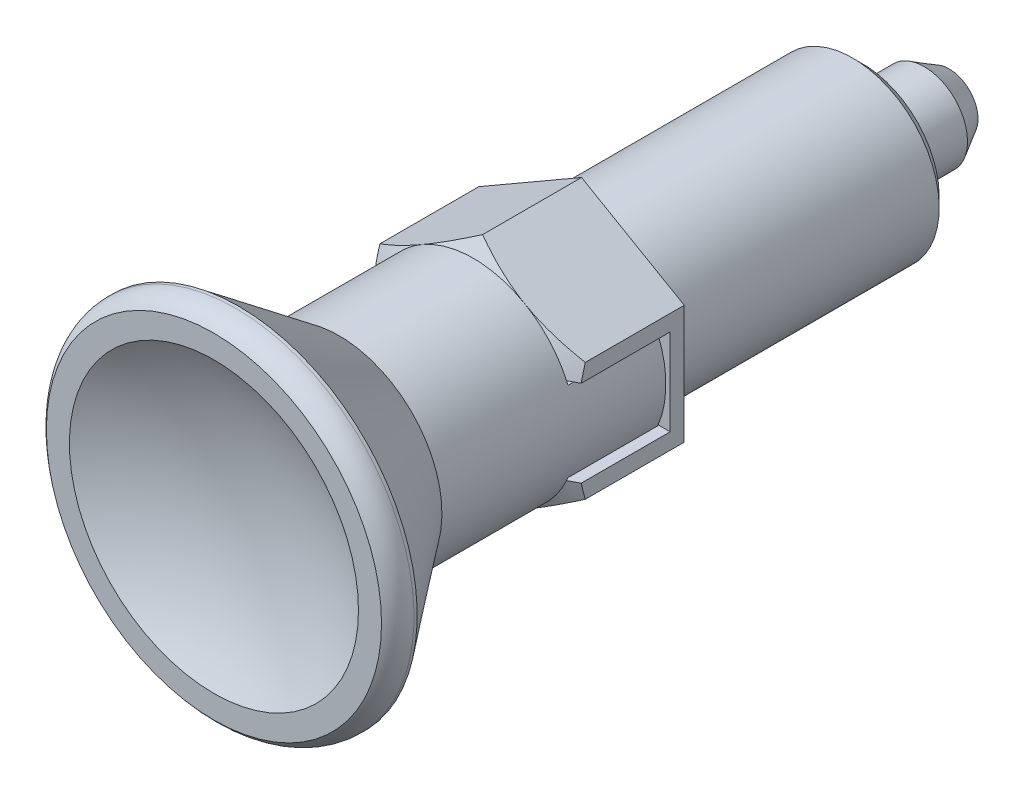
ISO-10303-21;
HEADER;
FILE_DESCRIPTION(('STEP AP214'),'2;1');
FILE_NAME('part.step','',(''),(''),'','','');
FILE_SCHEMA(('AUTOMOTIVE_DESIGN { 1 0 10303 214 1 1 1 1 }'));
ENDSEC;
DATA;
#1=APPLICATION_CONTEXT('core data for automotive mechanical design processes');
#2=APPLICATION_PROTOCOL_DEFINITION('international standard','automotive_design',2000,#1);
#3=PRODUCT_CONTEXT('',#1,'mechanical');
#4=PRODUCT('Part','Part','',(#3));
#5=PRODUCT_RELATED_PRODUCT_CATEGORY('part','',(#4));
#6=PRODUCT_DEFINITION_FORMATION('','',#4);
#7=PRODUCT_DEFINITION_CONTEXT('part definition',#1,'design');
#8=PRODUCT_DEFINITION('design','',#6,#7);
#9=PRODUCT_DEFINITION_SHAPE('','',#8);
#10=(LENGTH_UNIT() NAMED_UNIT(*) SI_UNIT(.MILLI.,.METRE.));
#11=(NAMED_UNIT(*) PLANE_ANGLE_UNIT() SI_UNIT($,.RADIAN.));
#12=(NAMED_UNIT(*) SI_UNIT($,.STERADIAN.) SOLID_ANGLE_UNIT());
#13=UNCERTAINTY_MEASURE_WITH_UNIT(LENGTH_MEASURE(1.E-05),#10,'distance_accuracy_value','');
#14=(GEOMETRIC_REPRESENTATION_CONTEXT(3) GLOBAL_UNCERTAINTY_ASSIGNED_CONTEXT((#13)) GLOBAL_UNIT_ASSIGNED_CONTEXT((#10,
#11,#12)) REPRESENTATION_CONTEXT('',''));
#15=CARTESIAN_POINT('',(0.,0.,0.));
#16=DIRECTION('',(0.,0.,1.));
#17=DIRECTION('',(1.,0.,0.));
#18=AXIS2_PLACEMENT_3D('',#15,#16,#17);
#19=CARTESIAN_POINT('',(9.5,-5.4848275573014,0.));
#20=DIRECTION('',(1.,0.,0.));
#21=DIRECTION('',(0.,1.,0.));
#22=AXIS2_PLACEMENT_3D('',#19,#20,#21);
#23=PLANE('',#22);
#24=DIRECTION('',(0.,-1.,0.));
#25=VECTOR('',#24,1.);
#26=CARTESIAN_POINT('',(9.5,0.,1.3));
#27=LINE('',#26,#25);
#28=CARTESIAN_POINT('',(9.5,4.,1.3));
#29=VERTEX_POINT('',#28);
#30=CARTESIAN_POINT('',(9.5,-4.,1.3));
#31=VERTEX_POINT('',#30);
#32=EDGE_CURVE('E504',#29,#31,#27,.T.);
#33=ORIENTED_EDGE('',*,*,#32,.T.);
#34=DIRECTION('',(0.,0.,1.));
#35=VECTOR('',#34,1.);
#36=CARTESIAN_POINT('',(9.5,-4.,0.));
#37=LINE('',#36,#35);
#38=CARTESIAN_POINT('',(9.5,-4.,9.53363720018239));
#39=VERTEX_POINT('',#38);
#40=EDGE_CURVE('E326',#31,#39,#37,.T.);
#41=ORIENTED_EDGE('',*,*,#40,.T.);
#42=CARTESIAN_POINT('',(9.5,0.551267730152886,9.99077331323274));
#43=CARTESIAN_POINT('',(9.5,0.360654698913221,9.99716698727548));
#44=CARTESIAN_POINT('',(9.5,0.169931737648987,10.0002326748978));
#45=CARTESIAN_POINT('',(9.5,-0.211493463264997,9.99974108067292));
#46=CARTESIAN_POINT('',(9.5,-0.402195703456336,9.99618422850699));
#47=CARTESIAN_POINT('',(9.5,-0.783158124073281,9.98248876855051));
#48=CARTESIAN_POINT('',(9.5,-0.973418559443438,9.97235726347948));
#49=CARTESIAN_POINT('',(9.5,-1.35348332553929,9.94568450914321));
#50=CARTESIAN_POINT('',(9.5,-1.54328765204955,9.92914320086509));
#51=CARTESIAN_POINT('',(9.5,-2.10800792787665,9.87063025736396));
#52=CARTESIAN_POINT('',(9.5,-2.48201643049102,9.81962425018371));
#53=CARTESIAN_POINT('',(9.5,-3.22643690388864,9.69597133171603));
#54=CARTESIAN_POINT('',(9.5,-3.5968480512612,9.62331958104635));
#55=CARTESIAN_POINT('',(9.5,-4.3314203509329,9.45996467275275));
#56=CARTESIAN_POINT('',(9.5,-4.69560503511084,9.36936622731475));
#57=CARTESIAN_POINT('',(9.5,-5.41982520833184,9.17287391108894));
#58=CARTESIAN_POINT('',(9.5,-5.77986020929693,9.06697826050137));
#59=CARTESIAN_POINT('',(9.5,-6.499653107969,8.84145642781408));
#60=CARTESIAN_POINT('',(9.5,-6.85936997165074,8.72170008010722));
#61=CARTESIAN_POINT('',(9.5,-7.396064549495,8.53425126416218));
#62=CARTESIAN_POINT('',(9.5,-7.57442990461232,8.47048610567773));
#63=CARTESIAN_POINT('',(9.5,-7.93028517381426,8.34058869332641));
#64=CARTESIAN_POINT('',(9.5,-8.10777513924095,8.27445658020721));
#65=CARTESIAN_POINT('',(9.5,-8.2848620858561,8.20726066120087));
#66=B_SPLINE_CURVE_WITH_KNOTS('',3,(#42,#43,#44,#45,#46,#47,#48,#49,#50,#51,#52,#53,#54,#55,#56,
#57,#58,#59,#60,#61,#62,#63,#64,#65),.UNSPECIFIED.,.F.,.F.,(4,2,2,2,2,2,2,2,2,2,2,4),(0.,
0.572128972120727,1.14422082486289,1.7156956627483,2.28717576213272,3.41879428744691,
4.55066600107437,5.67611850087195,6.80170205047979,7.93887673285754,8.50712553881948,
9.07534061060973),.UNSPECIFIED.);
#67=CARTESIAN_POINT('',(9.5,-5.4848275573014,9.15149422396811));
#68=VERTEX_POINT('',#67);
#69=EDGE_CURVE('E509',#39,#68,#66,.T.);
#70=ORIENTED_EDGE('',*,*,#69,.T.);
#71=DIRECTION('',(0.,0.,1.));
#72=VECTOR('',#71,1.);
#73=CARTESIAN_POINT('',(9.5,-5.4848275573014,0.));
#74=LINE('',#73,#72);
#75=CARTESIAN_POINT('',(9.5,-5.4848275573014,0.));
#76=VERTEX_POINT('',#75);
#77=EDGE_CURVE('E43',#76,#68,#74,.T.);
#78=ORIENTED_EDGE('',*,*,#77,.F.);
#79=DIRECTION('',(0.,1.,0.));
#80=VECTOR('',#79,1.);
#81=CARTESIAN_POINT('',(9.5,-5.4848275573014,0.));
#82=LINE('',#81,#80);
#83=CARTESIAN_POINT('',(9.5,5.4848275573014,0.));
#84=VERTEX_POINT('',#83);
#85=EDGE_CURVE('E331',#76,#84,#82,.T.);
#86=ORIENTED_EDGE('',*,*,#85,.T.);
#87=DIRECTION('',(0.,0.,1.));
#88=VECTOR('',#87,1.);
#89=CARTESIAN_POINT('',(9.5,5.4848275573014,0.));
#90=LINE('',#89,#88);
#91=CARTESIAN_POINT('',(9.5,5.4848275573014,9.15149422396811));
#92=VERTEX_POINT('',#91);
#93=EDGE_CURVE('E341',#84,#92,#90,.T.);
#94=ORIENTED_EDGE('',*,*,#93,.T.);
#95=CARTESIAN_POINT('',(9.5,9.4888517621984,7.7326599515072));
#96=CARTESIAN_POINT('',(9.5,9.31395254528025,7.80401760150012));
#97=CARTESIAN_POINT('',(9.5,9.13871029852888,7.87453339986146));
#98=CARTESIAN_POINT('',(9.5,8.78747792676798,8.01369578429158));
#99=CARTESIAN_POINT('',(9.5,8.61148777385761,8.0823422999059));
#100=CARTESIAN_POINT('',(9.5,8.08220780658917,8.28523563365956));
#101=CARTESIAN_POINT('',(9.5,7.72772214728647,8.41638959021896));
#102=CARTESIAN_POINT('',(9.5,7.01774083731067,8.66767738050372));
#103=CARTESIAN_POINT('',(9.5,6.66227114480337,8.78788422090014));
#104=CARTESIAN_POINT('',(9.5,5.94740967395,9.01610784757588));
#105=CARTESIAN_POINT('',(9.5,5.58801790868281,9.12412467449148));
#106=CARTESIAN_POINT('',(9.5,4.86337032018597,9.3257925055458));
#107=CARTESIAN_POINT('',(9.5,4.49809485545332,9.41937348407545));
#108=CARTESIAN_POINT('',(9.5,3.76342952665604,9.58849824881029));
#109=CARTESIAN_POINT('',(9.5,3.39404092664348,9.66404742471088));
#110=CARTESIAN_POINT('',(9.5,2.83589310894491,9.76175938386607));
#111=CARTESIAN_POINT('',(9.5,2.64849655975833,9.79180630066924));
#112=CARTESIAN_POINT('',(9.5,2.27287495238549,9.84618377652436));
#113=CARTESIAN_POINT('',(9.5,2.08464992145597,9.87051452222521));
#114=CARTESIAN_POINT('',(9.5,1.70729290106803,9.91315486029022));
#115=CARTESIAN_POINT('',(9.5,1.51816010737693,9.93145736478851));
#116=CARTESIAN_POINT('',(9.5,1.13936559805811,9.96175965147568));
#117=CARTESIAN_POINT('',(9.5,0.949703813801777,9.97375857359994));
#118=CARTESIAN_POINT('',(9.5,0.75988272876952,9.98248194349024));
#119=B_SPLINE_CURVE_WITH_KNOTS('',3,(#95,#96,#97,#98,#99,#100,#101,#102,#103,#104,#105,#106,
#107,#108,#109,#110,#111,#112,#113,#114,#115,#116,#117,#118),.UNSPECIFIED.,.F.,.F.,(4,2,2,2,2,2,
2,2,2,2,2,4),(0.,0.566683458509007,1.13338824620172,2.26716633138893,3.39272395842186,
4.51827783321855,5.64913060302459,6.77964493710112,7.34894185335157,7.91822017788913,
8.48816547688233,9.05818851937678),.UNSPECIFIED.);
#120=CARTESIAN_POINT('',(9.49999999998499,4.,9.53363720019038));
#121=VERTEX_POINT('',#120);
#122=EDGE_CURVE('E600',#92,#121,#119,.T.);
#123=ORIENTED_EDGE('',*,*,#122,.T.);
#124=DIRECTION('',(0.,0.,-1.));
#125=VECTOR('',#124,1.);
#126=CARTESIAN_POINT('',(9.5,4.,0.));
#127=LINE('',#126,#125);
#128=EDGE_CURVE('E299',#121,#29,#127,.T.);
#129=ORIENTED_EDGE('',*,*,#128,.T.);
#130=EDGE_LOOP('',(#33,#41,#70,#78,#86,#94,#123,#129));
#131=FACE_BOUND('',#130,.T.);
#132=ADVANCED_FACE('F14',(#131),#23,.T.);
#133=CARTESIAN_POINT('',(0.,0.,8.2679491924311));
#134=DIRECTION('',(0.,0.,-1.));
#135=DIRECTION('',(0.,1.,0.));
#136=AXIS2_PLACEMENT_3D('',#133,#134,#135);
#137=CONICAL_SURFACE('',#136,12.5,1.0471975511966);
#138=CARTESIAN_POINT('',(16.7831791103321,4.,5.52365123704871));
#139=CARTESIAN_POINT('',(16.4699871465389,4.,5.69954316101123));
#140=CARTESIAN_POINT('',(16.1566847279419,4.,5.8752385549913));
#141=CARTESIAN_POINT('',(15.5298133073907,4.,6.2261525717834));
#142=CARTESIAN_POINT('',(15.2162443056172,4.,6.40137119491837));
#143=CARTESIAN_POINT('',(14.2754273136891,4.,6.92598649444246));
#144=CARTESIAN_POINT('',(13.6477110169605,4.,7.27454408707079));
#145=CARTESIAN_POINT('',(12.3920784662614,4.,7.96752763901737));
#146=CARTESIAN_POINT('',(11.7641667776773,4.,8.31196184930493));
#147=CARTESIAN_POINT('',(10.8200624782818,4.,8.82493299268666));
#148=CARTESIAN_POINT('',(10.5048966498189,4.,8.99535883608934));
#149=CARTESIAN_POINT('',(9.87369206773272,4.,9.33458533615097));
#150=CARTESIAN_POINT('',(9.55765331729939,4.,9.503385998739));
#151=CARTESIAN_POINT('',(8.92291700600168,4.,9.83969783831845));
#152=CARTESIAN_POINT('',(8.60421399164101,4.,10.0071987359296));
#153=CARTESIAN_POINT('',(7.96536101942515,4.,10.3393555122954));
#154=CARTESIAN_POINT('',(7.64521119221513,4.,10.5040116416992));
#155=CARTESIAN_POINT('',(7.00341549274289,4.,10.8292149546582));
#156=CARTESIAN_POINT('',(6.68177249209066,4.,10.9897677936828));
#157=CARTESIAN_POINT('',(6.03570941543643,4.,11.3055123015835));
#158=CARTESIAN_POINT('',(5.71128843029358,4.,11.4607021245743));
#159=CARTESIAN_POINT('',(5.22107840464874,4.,11.6878901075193));
#160=CARTESIAN_POINT('',(5.05666952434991,4.,11.7628642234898));
#161=CARTESIAN_POINT('',(4.72674283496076,4.,11.9103269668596));
#162=CARTESIAN_POINT('',(4.56122505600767,4.,11.9828156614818));
#163=CARTESIAN_POINT('',(4.22901954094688,4.,12.1246629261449));
#164=CARTESIAN_POINT('',(4.06233294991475,4.,12.1940241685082));
#165=CARTESIAN_POINT('',(3.7274233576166,4.,12.328918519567));
#166=CARTESIAN_POINT('',(3.55920045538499,4.,12.3944518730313));
#167=CARTESIAN_POINT('',(3.22004404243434,4.,12.5210543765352));
#168=CARTESIAN_POINT('',(3.04910084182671,4.,12.5820977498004));
#169=CARTESIAN_POINT('',(2.70518685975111,4.,12.6980399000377));
#170=CARTESIAN_POINT('',(2.53221670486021,4.,12.7529405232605));
#171=CARTESIAN_POINT('',(2.18340909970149,4.,12.8552121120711));
#172=CARTESIAN_POINT('',(2.0075641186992,4.,12.9025578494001));
#173=CARTESIAN_POINT('',(1.65338379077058,4.,12.9876438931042));
#174=CARTESIAN_POINT('',(1.47504598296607,4.,13.0253738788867));
#175=CARTESIAN_POINT('',(1.29556082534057,4.,13.0573132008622));
#176=B_SPLINE_CURVE_WITH_KNOTS('',3,(#138,#139,#140,#141,#142,#143,#144,#145,#146,#147,#148,
#149,#150,#151,#152,#153,#154,#155,#156,#157,#158,#159,#160,#161,#162,#163,#164,#165,#166,#167,
#168,#169,#170,#171,#172,#173,#174,#175),.UNSPECIFIED.,.F.,.F.,(4,2,2,2,2,2,2,2,2,2,2,2,2,2,2,2,
2,2,4),(0.,1.07761058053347,2.15522043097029,4.30920688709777,6.45771731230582,7.53259530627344,
8.60746937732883,9.68757667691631,10.7675883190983,11.8460209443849,12.9248211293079,
13.4668963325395,14.0089568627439,14.5505450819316,15.0920986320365,15.6365513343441,
16.1808399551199,16.7269097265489,17.2735631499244),.UNSPECIFIED.);
#177=CARTESIAN_POINT('',(8.61684396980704,4.,10.));
#178=VERTEX_POINT('',#177);
#179=EDGE_CURVE('E292',#121,#178,#176,.T.);
#180=ORIENTED_EDGE('',*,*,#179,.F.);
#181=ORIENTED_EDGE('',*,*,#122,.F.);
#182=CARTESIAN_POINT('',(-0.000200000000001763,10.9697705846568,9.15142755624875));
#183=CARTESIAN_POINT('',(0.2086307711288,10.8492020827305,9.22102656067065));
#184=CARTESIAN_POINT('',(0.41824017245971,10.7281840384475,9.28746669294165));
#185=CARTESIAN_POINT('',(0.839139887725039,10.4851774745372,9.41315271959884));
#186=CARTESIAN_POINT('',(1.05043073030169,10.3631886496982,9.47239624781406));
#187=CARTESIAN_POINT('',(1.68770779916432,9.99525656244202,9.63818542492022));
#188=CARTESIAN_POINT('',(2.11620976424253,9.74786083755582,9.73248555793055));
#189=CARTESIAN_POINT('',(2.75744333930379,9.37764446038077,9.8430612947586));
#190=CARTESIAN_POINT('',(2.9682592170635,9.25592985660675,9.87456017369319));
#191=CARTESIAN_POINT('',(3.39086703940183,9.01193711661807,9.92738179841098));
#192=CARTESIAN_POINT('',(3.60265900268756,8.88965896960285,9.94870434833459));
#193=CARTESIAN_POINT('',(4.02659621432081,8.64489870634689,9.9806269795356));
#194=CARTESIAN_POINT('',(4.23874074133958,8.52241700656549,9.99123980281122));
#195=CARTESIAN_POINT('',(4.66322575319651,8.27734047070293,10.001517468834));
#196=CARTESIAN_POINT('',(4.87556623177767,8.15474563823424,10.0011826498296));
#197=CARTESIAN_POINT('',(5.27254199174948,7.92555157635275,9.99032663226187));
#198=CARTESIAN_POINT('',(5.45720529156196,7.81893617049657,9.9811297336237));
#199=CARTESIAN_POINT('',(5.82610000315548,7.60595470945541,9.95463460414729));
#200=CARTESIAN_POINT('',(6.01033138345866,7.49958867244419,9.93733580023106));
#201=CARTESIAN_POINT('',(6.56231167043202,7.18090270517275,9.8736955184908));
#202=CARTESIAN_POINT('',(6.92908353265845,6.96914687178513,9.81561809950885));
#203=CARTESIAN_POINT('',(7.66651782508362,6.54338898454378,9.67042398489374));
#204=CARTESIAN_POINT('',(8.03708614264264,6.32944126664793,9.58269183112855));
#205=CARTESIAN_POINT('',(8.77269671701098,5.90473630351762,9.38357626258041));
#206=CARTESIAN_POINT('',(9.137748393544,5.69397361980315,9.27223961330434));
#207=CARTESIAN_POINT('',(9.5002,5.48471208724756,9.15142755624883));
#208=B_SPLINE_CURVE_WITH_KNOTS('',3,(#182,#183,#184,#185,#186,#187,#188,#189,#190,#191,#192,
#193,#194,#195,#196,#197,#198,#199,#200,#201,#202,#203,#204,#205,#206,#207),.UNSPECIFIED.,.F.,
.F.,(4,2,2,2,2,2,2,2,2,2,2,2,4),(0.,0.752880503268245,1.50600787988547,3.01546870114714,
3.75167336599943,4.48789219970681,5.22323407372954,5.95855322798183,6.59868084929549,
7.23885375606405,8.52010929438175,9.82978009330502,11.1368800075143),.UNSPECIFIED.);
#209=CARTESIAN_POINT('',(4.75000000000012,8.22724133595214,10.));
#210=VERTEX_POINT('',#209);
#211=EDGE_CURVE('E456',#210,#92,#208,.T.);
#212=ORIENTED_EDGE('',*,*,#211,.F.);
#213=CARTESIAN_POINT('',(0.,0.,10.));
#214=DIRECTION('',(0.,0.,1.));
#215=DIRECTION('',(0.,-1.,0.));
#216=AXIS2_PLACEMENT_3D('',#213,#214,#215);
#217=CIRCLE('',#216,9.5);
#218=EDGE_CURVE('E421',#178,#210,#217,.T.);
#219=ORIENTED_EDGE('',*,*,#218,.F.);
#220=EDGE_LOOP('',(#180,#181,#212,#219));
#221=FACE_BOUND('',#220,.T.);
#222=ADVANCED_FACE('F497',(#221),#137,.T.);
#223=CARTESIAN_POINT('',(1.01482098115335,-4.,13.1022615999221));
#224=CARTESIAN_POINT('',(1.16792107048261,-4.,13.0805410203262));
#225=CARTESIAN_POINT('',(1.32030625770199,-4.,13.0542641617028));
#226=CARTESIAN_POINT('',(1.62337845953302,-4.,12.993830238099));
#227=CARTESIAN_POINT('',(1.77406683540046,-4.,12.959680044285));
#228=CARTESIAN_POINT('',(2.07323793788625,-4.,12.8848164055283));
#229=CARTESIAN_POINT('',(2.22172639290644,-4.,12.8441255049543));
#230=CARTESIAN_POINT('',(2.51710306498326,-4.,12.7572119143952));
#231=CARTESIAN_POINT('',(2.66399088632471,-4.,12.7109878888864));
#232=CARTESIAN_POINT('',(2.95531622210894,-4.,12.6143009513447));
#233=CARTESIAN_POINT('',(3.09976338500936,-4.,12.5638669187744));
#234=CARTESIAN_POINT('',(3.38731657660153,-4.,12.4592988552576));
#235=CARTESIAN_POINT('',(3.53042250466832,-4.,12.4051645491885));
#236=CARTESIAN_POINT('',(3.95823196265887,-4.,12.2381261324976));
#237=CARTESIAN_POINT('',(4.24116083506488,-4.,12.1206777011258));
#238=CARTESIAN_POINT('',(4.71672009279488,-4.,11.9149988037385));
#239=CARTESIAN_POINT('',(4.91029901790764,-4.,11.8289229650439));
#240=CARTESIAN_POINT('',(5.29604151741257,-4.,11.6536457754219));
#241=CARTESIAN_POINT('',(5.4882050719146,-4.,11.5644443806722));
#242=CARTESIAN_POINT('',(5.87129836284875,-4.,11.3836082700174));
#243=CARTESIAN_POINT('',(6.06222850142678,-4.,11.2919744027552));
#244=CARTESIAN_POINT('',(6.4431260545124,-4.,11.1067240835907));
#245=CARTESIAN_POINT('',(6.63309345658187,-4.,11.0131076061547));
#246=CARTESIAN_POINT('',(7.20347389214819,-4.,10.7290337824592));
#247=CARTESIAN_POINT('',(7.58268061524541,-4.,10.5361558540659));
#248=CARTESIAN_POINT('',(8.33884864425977,-4.,10.1460458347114));
#249=CARTESIAN_POINT('',(8.71580989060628,-4.,9.94881362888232));
#250=CARTESIAN_POINT('',(9.41422347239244,-4.,9.5797222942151));
#251=CARTESIAN_POINT('',(9.73589367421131,-4.,9.40827479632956));
#252=CARTESIAN_POINT('',(10.3782993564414,-4.,9.06363703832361));
#253=CARTESIAN_POINT('',(10.6990348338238,-4.,8.89044677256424));
#254=CARTESIAN_POINT('',(11.6601419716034,-4.,8.36886589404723));
#255=CARTESIAN_POINT('',(12.299420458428,-4.,8.01846194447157));
#256=CARTESIAN_POINT('',(13.5703836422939,-4.,7.31739692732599));
#257=CARTESIAN_POINT('',(14.2020851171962,-4.,6.96676619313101));
#258=CARTESIAN_POINT('',(15.1486648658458,-4.,6.43910369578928));
#259=CARTESIAN_POINT('',(15.4640237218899,-4.,6.26293330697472));
#260=CARTESIAN_POINT('',(16.0944683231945,-4.,5.9101049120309));
#261=CARTESIAN_POINT('',(16.4095540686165,-4.,5.73344690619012));
#262=CARTESIAN_POINT('',(16.7245270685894,-4.,5.55658827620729));
#263=B_SPLINE_CURVE_WITH_KNOTS('',3,(#223,#224,#225,#226,#227,#228,#229,#230,#231,#232,#233,
#234,#235,#236,#237,#238,#239,#240,#241,#242,#243,#244,#245,#246,#247,#248,#249,#250,#251,#252,
#253,#254,#255,#256,#257,#258,#259,#260,#261,#262),.UNSPECIFIED.,.F.,.F.,(4,2,2,2,2,2,2,2,2,2,2,
2,2,2,2,2,2,2,2,4),(0.,0.463733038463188,0.927062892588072,1.38882870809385,1.85070620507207,
2.30964133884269,2.76861063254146,3.68739295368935,4.32293206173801,4.95848008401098,
5.59380921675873,6.22914653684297,7.50541980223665,8.78172677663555,9.87524343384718,
10.9687636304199,13.1557832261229,15.3232410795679,16.4069311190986,17.4906205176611),.UNSPECIFIED.);
#264=CARTESIAN_POINT('',(8.61684396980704,-4.,10.));
#265=VERTEX_POINT('',#264);
#266=EDGE_CURVE('E320',#265,#39,#263,.T.);
#267=ORIENTED_EDGE('',*,*,#266,.F.);
#268=CARTESIAN_POINT('',(4.75000000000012,-8.22724133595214,10.));
#269=VERTEX_POINT('',#268);
#270=EDGE_CURVE('E552',#269,#265,#217,.T.);
#271=ORIENTED_EDGE('',*,*,#270,.F.);
#272=CARTESIAN_POINT('',(9.5002,-5.48471208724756,9.15142755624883));
#273=CARTESIAN_POINT('',(9.2913692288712,-5.60528058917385,9.22102656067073));
#274=CARTESIAN_POINT('',(9.08175982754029,-5.72629863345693,9.28746669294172));
#275=CARTESIAN_POINT('',(8.66086011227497,-5.96930519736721,9.4131527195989));
#276=CARTESIAN_POINT('',(8.44956926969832,-6.09129402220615,9.47239624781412));
#277=CARTESIAN_POINT('',(7.81229220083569,-6.45922610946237,9.63818542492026));
#278=CARTESIAN_POINT('',(7.38379023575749,-6.70662183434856,9.73248555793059));
#279=CARTESIAN_POINT('',(6.74255666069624,-7.07683821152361,9.84306129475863));
#280=CARTESIAN_POINT('',(6.53174078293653,-7.19855281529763,9.87456017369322));
#281=CARTESIAN_POINT('',(6.1091329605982,-7.44254555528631,9.927381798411));
#282=CARTESIAN_POINT('',(5.89734099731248,-7.56482370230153,9.94870434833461));
#283=CARTESIAN_POINT('',(5.47340378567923,-7.80958396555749,9.98062697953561));
#284=CARTESIAN_POINT('',(5.26125925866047,-7.93206566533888,9.99123980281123));
#285=CARTESIAN_POINT('',(4.83677424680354,-8.17714220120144,10.0015174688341));
#286=CARTESIAN_POINT('',(4.62443376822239,-8.29973703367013,10.0011826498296));
#287=CARTESIAN_POINT('',(4.22745800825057,-8.52893109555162,9.99032663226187));
#288=CARTESIAN_POINT('',(4.04279470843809,-8.63554650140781,9.98112973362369));
#289=CARTESIAN_POINT('',(3.67389999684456,-8.84852796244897,9.95463460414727));
#290=CARTESIAN_POINT('',(3.48966861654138,-8.95489399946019,9.93733580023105));
#291=CARTESIAN_POINT('',(2.93768832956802,-9.27357996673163,9.87369551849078));
#292=CARTESIAN_POINT('',(2.57091646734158,-9.48533580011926,9.81561809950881));
#293=CARTESIAN_POINT('',(1.8334821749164,-9.91109368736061,9.67042398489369));
#294=CARTESIAN_POINT('',(1.46291385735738,-10.1250414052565,9.5826918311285));
#295=CARTESIAN_POINT('',(0.727303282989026,-10.5497463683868,9.38357626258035));
#296=CARTESIAN_POINT('',(0.362251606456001,-10.7605090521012,9.27223961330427));
#297=CARTESIAN_POINT('',(-0.000199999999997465,-10.9697705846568,9.15142755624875));
#298=B_SPLINE_CURVE_WITH_KNOTS('',3,(#272,#273,#274,#275,#276,#277,#278,#279,#280,#281,#282,
#283,#284,#285,#286,#287,#288,#289,#290,#291,#292,#293,#294,#295,#296,#297),.UNSPECIFIED.,.F.,
.F.,(4,2,2,2,2,2,2,2,2,2,2,2,4),(0.,0.752880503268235,1.50600787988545,3.0154687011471,
3.75167336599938,4.48789219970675,5.22323407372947,5.95855322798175,6.59868084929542,
7.23885375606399,8.52010929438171,9.829780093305,11.1368800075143),.UNSPECIFIED.);
#299=EDGE_CURVE('E398',#68,#269,#298,.T.);
#300=ORIENTED_EDGE('',*,*,#299,.F.);
#301=ORIENTED_EDGE('',*,*,#69,.F.);
#302=EDGE_LOOP('',(#267,#271,#300,#301));
#303=FACE_BOUND('',#302,.T.);
#304=ADVANCED_FACE('F492',(#303),#137,.T.);
#305=CARTESIAN_POINT('',(0.,0.,-34.));
#306=DIRECTION('',(0.,0.,1.));
#307=DIRECTION('',(0.,-1.,0.));
#308=AXIS2_PLACEMENT_3D('',#305,#306,#307);
#309=CYLINDRICAL_SURFACE('',#308,9.5);
#310=CARTESIAN_POINT('',(0.,0.,1.7));
#311=DIRECTION('',(0.,0.,1.));
#312=DIRECTION('',(0.,-1.,0.));
#313=AXIS2_PLACEMENT_3D('',#310,#311,#312);
#314=CIRCLE('',#313,9.5);
#315=CARTESIAN_POINT('',(-8.7498571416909,-3.7,1.7));
#316=VERTEX_POINT('',#315);
#317=CARTESIAN_POINT('',(-8.7498571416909,3.7,1.7));
#318=VERTEX_POINT('',#317);
#319=EDGE_CURVE('E242',#316,#318,#314,.F.);
#320=ORIENTED_EDGE('',*,*,#319,.F.);
#321=DIRECTION('',(0.,0.,1.));
#322=VECTOR('',#321,1.);
#323=CARTESIAN_POINT('',(-8.7498571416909,-3.7,1.3));
#324=LINE('',#323,#322);
#325=CARTESIAN_POINT('',(-8.74985714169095,-3.7,10.));
#326=VERTEX_POINT('',#325);
#327=EDGE_CURVE('E408',#316,#326,#324,.T.);
#328=ORIENTED_EDGE('',*,*,#327,.T.);
#329=CARTESIAN_POINT('',(-8.61684396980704,-4.,10.));
#330=VERTEX_POINT('',#329);
#331=EDGE_CURVE('E423',#326,#330,#217,.T.);
#332=ORIENTED_EDGE('',*,*,#331,.T.);
#333=CARTESIAN_POINT('',(-4.75000000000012,-8.22724133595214,10.));
#334=VERTEX_POINT('',#333);
#335=EDGE_CURVE('E422',#330,#334,#217,.T.);
#336=ORIENTED_EDGE('',*,*,#335,.T.);
#337=EDGE_CURVE('E553',#334,#269,#217,.T.);
#338=ORIENTED_EDGE('',*,*,#337,.T.);
#339=ORIENTED_EDGE('',*,*,#270,.T.);
#340=CARTESIAN_POINT('',(8.74985714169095,-3.7,10.));
#341=VERTEX_POINT('',#340);
#342=EDGE_CURVE('E416',#265,#341,#217,.T.);
#343=ORIENTED_EDGE('',*,*,#342,.T.);
#344=DIRECTION('',(0.,0.,1.));
#345=VECTOR('',#344,1.);
#346=CARTESIAN_POINT('',(8.7498571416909,-3.7,1.3));
#347=LINE('',#346,#345);
#348=CARTESIAN_POINT('',(8.7498571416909,-3.7,1.7));
#349=VERTEX_POINT('',#348);
#350=EDGE_CURVE('E411',#349,#341,#347,.T.);
#351=ORIENTED_EDGE('',*,*,#350,.F.);
#352=CARTESIAN_POINT('',(0.,0.,1.7));
#353=DIRECTION('',(0.,0.,-1.));
#354=DIRECTION('',(0.,1.,0.));
#355=AXIS2_PLACEMENT_3D('',#352,#353,#354);
#356=CIRCLE('',#355,9.5);
#357=CARTESIAN_POINT('',(8.74985714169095,3.7,1.7));
#358=VERTEX_POINT('',#357);
#359=EDGE_CURVE('E536',#349,#358,#356,.F.);
#360=ORIENTED_EDGE('',*,*,#359,.T.);
#361=DIRECTION('',(0.,0.,1.));
#362=VECTOR('',#361,1.);
#363=CARTESIAN_POINT('',(8.7498571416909,3.7,1.3));
#364=LINE('',#363,#362);
#365=CARTESIAN_POINT('',(8.74985714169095,3.7,10.));
#366=VERTEX_POINT('',#365);
#367=EDGE_CURVE('E413',#358,#366,#364,.T.);
#368=ORIENTED_EDGE('',*,*,#367,.T.);
#369=EDGE_CURVE('E417',#366,#178,#217,.T.);
#370=ORIENTED_EDGE('',*,*,#369,.T.);
#371=ORIENTED_EDGE('',*,*,#218,.T.);
#372=CARTESIAN_POINT('',(-4.75000000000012,8.22724133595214,10.));
#373=VERTEX_POINT('',#372);
#374=EDGE_CURVE('E529',#210,#373,#217,.T.);
#375=ORIENTED_EDGE('',*,*,#374,.T.);
#376=CARTESIAN_POINT('',(-8.61684396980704,4.,10.));
#377=VERTEX_POINT('',#376);
#378=EDGE_CURVE('E554',#373,#377,#217,.T.);
#379=ORIENTED_EDGE('',*,*,#378,.T.);
#380=CARTESIAN_POINT('',(-8.7498571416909,3.7,10.));
#381=VERTEX_POINT('',#380);
#382=EDGE_CURVE('E530',#377,#381,#217,.T.);
#383=ORIENTED_EDGE('',*,*,#382,.T.);
#384=DIRECTION('',(0.,0.,1.));
#385=VECTOR('',#384,1.);
#386=CARTESIAN_POINT('',(-8.7498571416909,3.7,1.3));
#387=LINE('',#386,#385);
#388=EDGE_CURVE('E405',#318,#381,#387,.T.);
#389=ORIENTED_EDGE('',*,*,#388,.F.);
#390=EDGE_LOOP('',(#320,#328,#332,#336,#338,#339,#343,#351,#360,#368,#370,#371,#375,#379,#383,#389));
#391=FACE_BOUND('',#390,.T.);
#392=CARTESIAN_POINT('',(0.,0.,22.410686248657));
#393=DIRECTION('',(0.,0.,1.));
#394=DIRECTION('',(0.,-1.,0.));
#395=AXIS2_PLACEMENT_3D('',#392,#393,#394);
#396=CIRCLE('',#395,9.5);
#397=CARTESIAN_POINT('',(0.,-9.5,22.410686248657));
#398=VERTEX_POINT('',#397);
#399=EDGE_CURVE('E441',#398,#398,#396,.T.);
#400=ORIENTED_EDGE('',*,*,#399,.F.);
#401=EDGE_LOOP('',(#400));
#402=FACE_BOUND('',#401,.T.);
#403=ADVANCED_FACE('F532',(#391,#402),#309,.T.);
#404=CARTESIAN_POINT('',(8.,0.,0.));
#405=DIRECTION('',(0.,0.,1.));
#406=DIRECTION('',(0.,-1.,0.));
#407=AXIS2_PLACEMENT_3D('',#404,#405,#406);
#408=PLANE('',#407);
#409=CARTESIAN_POINT('',(0.,0.,0.));
#410=DIRECTION('',(0.,0.,1.));
#411=DIRECTION('',(0.,-1.,0.));
#412=AXIS2_PLACEMENT_3D('',#409,#410,#411);
#413=CIRCLE('',#412,8.);
#414=CARTESIAN_POINT('',(0.,-8.,0.));
#415=VERTEX_POINT('',#414);
#416=EDGE_CURVE('E420',#415,#415,#413,.T.);
#417=ORIENTED_EDGE('',*,*,#416,.T.);
#418=EDGE_LOOP('',(#417));
#419=FACE_BOUND('',#418,.T.);
#420=DIRECTION('',(-0.866025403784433,0.500000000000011,0.));
#421=VECTOR('',#420,1.);
#422=CARTESIAN_POINT('',(9.5,5.4848275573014,0.));
#423=LINE('',#422,#421);
#424=CARTESIAN_POINT('',(0.,10.969655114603,0.));
#425=VERTEX_POINT('',#424);
#426=EDGE_CURVE('E329',#84,#425,#423,.T.);
#427=ORIENTED_EDGE('',*,*,#426,.F.);
#428=ORIENTED_EDGE('',*,*,#85,.F.);
#429=DIRECTION('',(0.866025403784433,0.500000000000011,0.));
#430=VECTOR('',#429,1.);
#431=CARTESIAN_POINT('',(0.,-10.969655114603,0.));
#432=LINE('',#431,#430);
#433=CARTESIAN_POINT('',(0.,-10.969655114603,0.));
#434=VERTEX_POINT('',#433);
#435=EDGE_CURVE('E333',#434,#76,#432,.T.);
#436=ORIENTED_EDGE('',*,*,#435,.F.);
#437=DIRECTION('',(0.866025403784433,-0.500000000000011,0.));
#438=VECTOR('',#437,1.);
#439=CARTESIAN_POINT('',(-9.5,-5.4848275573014,0.));
#440=LINE('',#439,#438);
#441=CARTESIAN_POINT('',(-9.5,-5.4848275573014,0.));
#442=VERTEX_POINT('',#441);
#443=EDGE_CURVE('E335',#442,#434,#440,.T.);
#444=ORIENTED_EDGE('',*,*,#443,.F.);
#445=DIRECTION('',(0.,-1.,0.));
#446=VECTOR('',#445,1.);
#447=CARTESIAN_POINT('',(-9.5,5.4848275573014,0.));
#448=LINE('',#447,#446);
#449=CARTESIAN_POINT('',(-9.5,5.4848275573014,0.));
#450=VERTEX_POINT('',#449);
#451=EDGE_CURVE('E337',#450,#442,#448,.T.);
#452=ORIENTED_EDGE('',*,*,#451,.F.);
#453=DIRECTION('',(-0.866025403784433,-0.500000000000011,0.));
#454=VECTOR('',#453,1.);
#455=CARTESIAN_POINT('',(0.,10.969655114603,0.));
#456=LINE('',#455,#454);
#457=EDGE_CURVE('E339',#425,#450,#456,.T.);
#458=ORIENTED_EDGE('',*,*,#457,.F.);
#459=EDGE_LOOP('',(#427,#428,#436,#444,#452,#458));
#460=FACE_BOUND('',#459,.T.);
#461=ADVANCED_FACE('F385',(#419,#460),#408,.F.);
#462=CARTESIAN_POINT('',(-9.5,-5.4848275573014,0.));
#463=DIRECTION('',(-0.500000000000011,-0.866025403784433,0.));
#464=DIRECTION('',(0.866025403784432,-0.500000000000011,0.));
#465=AXIS2_PLACEMENT_3D('',#462,#463,#464);
#466=PLANE('',#465);
#467=CARTESIAN_POINT('',(0.000200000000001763,-10.9697705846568,9.15142755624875));
#468=CARTESIAN_POINT('',(-0.2086307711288,-10.8492020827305,9.22102656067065));
#469=CARTESIAN_POINT('',(-0.41824017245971,-10.7281840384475,9.28746669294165));
#470=CARTESIAN_POINT('',(-0.839139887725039,-10.4851774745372,9.41315271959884));
#471=CARTESIAN_POINT('',(-1.05043073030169,-10.3631886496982,9.47239624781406));
#472=CARTESIAN_POINT('',(-1.68770779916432,-9.99525656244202,9.63818542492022));
#473=CARTESIAN_POINT('',(-2.11620976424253,-9.74786083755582,9.73248555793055));
#474=CARTESIAN_POINT('',(-2.75744333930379,-9.37764446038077,9.8430612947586));
#475=CARTESIAN_POINT('',(-2.9682592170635,-9.25592985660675,9.87456017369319));
#476=CARTESIAN_POINT('',(-3.39086703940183,-9.01193711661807,9.92738179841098));
#477=CARTESIAN_POINT('',(-3.60265900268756,-8.88965896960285,9.94870434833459));
#478=CARTESIAN_POINT('',(-4.02659621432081,-8.64489870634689,9.9806269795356));
#479=CARTESIAN_POINT('',(-4.23874074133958,-8.52241700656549,9.99123980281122));
#480=CARTESIAN_POINT('',(-4.66322575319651,-8.27734047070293,10.001517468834));
#481=CARTESIAN_POINT('',(-4.87556623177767,-8.15474563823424,10.0011826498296));
#482=CARTESIAN_POINT('',(-5.27254199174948,-7.92555157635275,9.99032663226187));
#483=CARTESIAN_POINT('',(-5.45720529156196,-7.81893617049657,9.9811297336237));
#484=CARTESIAN_POINT('',(-5.82610000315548,-7.60595470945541,9.95463460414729));
#485=CARTESIAN_POINT('',(-6.01033138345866,-7.49958867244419,9.93733580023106));
#486=CARTESIAN_POINT('',(-6.56231167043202,-7.18090270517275,9.8736955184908));
#487=CARTESIAN_POINT('',(-6.92908353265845,-6.96914687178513,9.81561809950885));
#488=CARTESIAN_POINT('',(-7.66651782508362,-6.54338898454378,9.67042398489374));
#489=CARTESIAN_POINT('',(-8.03708614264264,-6.32944126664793,9.58269183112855));
#490=CARTESIAN_POINT('',(-8.77269671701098,-5.90473630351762,9.38357626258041));
#491=CARTESIAN_POINT('',(-9.137748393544,-5.69397361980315,9.27223961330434));
#492=CARTESIAN_POINT('',(-9.5002,-5.48471208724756,9.15142755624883));
#493=B_SPLINE_CURVE_WITH_KNOTS('',3,(#467,#468,#469,#470,#471,#472,#473,#474,#475,#476,#477,
#478,#479,#480,#481,#482,#483,#484,#485,#486,#487,#488,#489,#490,#491,#492),.UNSPECIFIED.,.F.,
.F.,(4,2,2,2,2,2,2,2,2,2,2,2,4),(0.,0.752880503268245,1.50600787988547,3.01546870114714,
3.75167336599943,4.48789219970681,5.22323407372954,5.95855322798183,6.59868084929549,
7.23885375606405,8.52010929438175,9.82978009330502,11.1368800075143),.UNSPECIFIED.);
#494=CARTESIAN_POINT('',(0.,-10.969655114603,9.15149422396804));
#495=VERTEX_POINT('',#494);
#496=EDGE_CURVE('E397',#495,#334,#493,.T.);
#497=ORIENTED_EDGE('',*,*,#496,.T.);
#498=CARTESIAN_POINT('',(-9.5,-5.4848275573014,9.15149422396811));
#499=VERTEX_POINT('',#498);
#500=EDGE_CURVE('E390',#334,#499,#493,.T.);
#501=ORIENTED_EDGE('',*,*,#500,.T.);
#502=DIRECTION('',(0.,0.,1.));
#503=VECTOR('',#502,1.);
#504=CARTESIAN_POINT('',(-9.5,-5.4848275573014,0.));
#505=LINE('',#504,#503);
#506=EDGE_CURVE('E346',#442,#499,#505,.T.);
#507=ORIENTED_EDGE('',*,*,#506,.F.);
#508=ORIENTED_EDGE('',*,*,#443,.T.);
#509=DIRECTION('',(0.,0.,1.));
#510=VECTOR('',#509,1.);
#511=CARTESIAN_POINT('',(0.,-10.969655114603,0.));
#512=LINE('',#511,#510);
#513=EDGE_CURVE('E349',#434,#495,#512,.T.);
#514=ORIENTED_EDGE('',*,*,#513,.T.);
#515=EDGE_LOOP('',(#497,#501,#507,#508,#514));
#516=FACE_BOUND('',#515,.T.);
#517=ADVANCED_FACE('F379',(#516),#466,.T.);
#518=CARTESIAN_POINT('',(0.,-10.969655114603,0.));
#519=DIRECTION('',(0.500000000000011,-0.866025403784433,0.));
#520=DIRECTION('',(0.866025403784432,0.500000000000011,0.));
#521=AXIS2_PLACEMENT_3D('',#518,#519,#520);
#522=PLANE('',#521);
#523=ORIENTED_EDGE('',*,*,#299,.T.);
#524=EDGE_CURVE('E399',#269,#495,#298,.T.);
#525=ORIENTED_EDGE('',*,*,#524,.T.);
#526=ORIENTED_EDGE('',*,*,#513,.F.);
#527=ORIENTED_EDGE('',*,*,#435,.T.);
#528=ORIENTED_EDGE('',*,*,#77,.T.);
#529=EDGE_LOOP('',(#523,#525,#526,#527,#528));
#530=FACE_BOUND('',#529,.T.);
#531=ADVANCED_FACE('F384',(#530),#522,.T.);
#532=CARTESIAN_POINT('',(9.5,5.4848275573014,0.));
#533=DIRECTION('',(0.500000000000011,0.866025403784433,0.));
#534=DIRECTION('',(-0.866025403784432,0.500000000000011,0.));
#535=AXIS2_PLACEMENT_3D('',#532,#533,#534);
#536=PLANE('',#535);
#537=CARTESIAN_POINT('',(0.,10.969655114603,9.15149422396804));
#538=VERTEX_POINT('',#537);
#539=EDGE_CURVE('E463',#538,#210,#208,.T.);
#540=ORIENTED_EDGE('',*,*,#539,.T.);
#541=ORIENTED_EDGE('',*,*,#211,.T.);
#542=ORIENTED_EDGE('',*,*,#93,.F.);
#543=ORIENTED_EDGE('',*,*,#426,.T.);
#544=DIRECTION('',(0.,0.,1.));
#545=VECTOR('',#544,1.);
#546=CARTESIAN_POINT('',(0.,10.969655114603,0.));
#547=LINE('',#546,#545);
#548=EDGE_CURVE('E345',#425,#538,#547,.T.);
#549=ORIENTED_EDGE('',*,*,#548,.T.);
#550=EDGE_LOOP('',(#540,#541,#542,#543,#549));
#551=FACE_BOUND('',#550,.T.);
#552=ADVANCED_FACE('F470',(#551),#536,.T.);
#553=CARTESIAN_POINT('',(0.,10.969655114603,0.));
#554=DIRECTION('',(-0.500000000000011,0.866025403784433,0.));
#555=DIRECTION('',(-0.866025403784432,-0.500000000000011,0.));
#556=AXIS2_PLACEMENT_3D('',#553,#554,#555);
#557=PLANE('',#556);
#558=CARTESIAN_POINT('',(-9.5002,5.48471208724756,9.15142755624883));
#559=CARTESIAN_POINT('',(-9.2913692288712,5.60528058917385,9.22102656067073));
#560=CARTESIAN_POINT('',(-9.08175982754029,5.72629863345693,9.28746669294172));
#561=CARTESIAN_POINT('',(-8.66086011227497,5.96930519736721,9.4131527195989));
#562=CARTESIAN_POINT('',(-8.44956926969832,6.09129402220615,9.47239624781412));
#563=CARTESIAN_POINT('',(-7.81229220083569,6.45922610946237,9.63818542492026));
#564=CARTESIAN_POINT('',(-7.38379023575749,6.70662183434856,9.73248555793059));
#565=CARTESIAN_POINT('',(-6.74255666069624,7.07683821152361,9.84306129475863));
#566=CARTESIAN_POINT('',(-6.53174078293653,7.19855281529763,9.87456017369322));
#567=CARTESIAN_POINT('',(-6.1091329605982,7.44254555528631,9.927381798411));
#568=CARTESIAN_POINT('',(-5.89734099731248,7.56482370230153,9.94870434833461));
#569=CARTESIAN_POINT('',(-5.47340378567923,7.80958396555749,9.98062697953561));
#570=CARTESIAN_POINT('',(-5.26125925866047,7.93206566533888,9.99123980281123));
#571=CARTESIAN_POINT('',(-4.83677424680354,8.17714220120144,10.0015174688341));
#572=CARTESIAN_POINT('',(-4.62443376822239,8.29973703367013,10.0011826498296));
#573=CARTESIAN_POINT('',(-4.22745800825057,8.52893109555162,9.99032663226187));
#574=CARTESIAN_POINT('',(-4.04279470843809,8.63554650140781,9.98112973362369));
#575=CARTESIAN_POINT('',(-3.67389999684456,8.84852796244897,9.95463460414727));
#576=CARTESIAN_POINT('',(-3.48966861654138,8.95489399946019,9.93733580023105));
#577=CARTESIAN_POINT('',(-2.93768832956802,9.27357996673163,9.87369551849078));
#578=CARTESIAN_POINT('',(-2.57091646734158,9.48533580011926,9.81561809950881));
#579=CARTESIAN_POINT('',(-1.8334821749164,9.91109368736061,9.67042398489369));
#580=CARTESIAN_POINT('',(-1.46291385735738,10.1250414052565,9.5826918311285));
#581=CARTESIAN_POINT('',(-0.727303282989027,10.5497463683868,9.38357626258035));
#582=CARTESIAN_POINT('',(-0.362251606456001,10.7605090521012,9.27223961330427));
#583=CARTESIAN_POINT('',(0.000199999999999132,10.9697705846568,9.15142755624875));
#584=B_SPLINE_CURVE_WITH_KNOTS('',3,(#558,#559,#560,#561,#562,#563,#564,#565,#566,#567,#568,
#569,#570,#571,#572,#573,#574,#575,#576,#577,#578,#579,#580,#581,#582,#583),.UNSPECIFIED.,.F.,
.F.,(4,2,2,2,2,2,2,2,2,2,2,2,4),(0.,0.752880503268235,1.50600787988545,3.0154687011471,
3.75167336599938,4.48789219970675,5.22323407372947,5.95855322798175,6.59868084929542,
7.23885375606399,8.52010929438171,9.829780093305,11.1368800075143),.UNSPECIFIED.);
#585=CARTESIAN_POINT('',(-9.5,5.4848275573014,9.15149422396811));
#586=VERTEX_POINT('',#585);
#587=EDGE_CURVE('E627',#586,#373,#584,.T.);
#588=ORIENTED_EDGE('',*,*,#587,.T.);
#589=EDGE_CURVE('E464',#373,#538,#584,.T.);
#590=ORIENTED_EDGE('',*,*,#589,.T.);
#591=ORIENTED_EDGE('',*,*,#548,.F.);
#592=ORIENTED_EDGE('',*,*,#457,.T.);
#593=DIRECTION('',(0.,0.,1.));
#594=VECTOR('',#593,1.);
#595=CARTESIAN_POINT('',(-9.5,5.4848275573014,0.));
#596=LINE('',#595,#594);
#597=EDGE_CURVE('E342',#450,#586,#596,.T.);
#598=ORIENTED_EDGE('',*,*,#597,.T.);
#599=EDGE_LOOP('',(#588,#590,#591,#592,#598));
#600=FACE_BOUND('',#599,.T.);
#601=ADVANCED_FACE('F376',(#600),#557,.T.);
#602=CARTESIAN_POINT('',(-9.5,5.4848275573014,0.));
#603=DIRECTION('',(-1.,0.,0.));
#604=DIRECTION('',(0.,-1.,0.));
#605=AXIS2_PLACEMENT_3D('',#602,#603,#604);
#606=PLANE('',#605);
#607=DIRECTION('',(0.,0.,1.));
#608=VECTOR('',#607,1.);
#609=CARTESIAN_POINT('',(-9.5,-4.,0.));
#610=LINE('',#609,#608);
#611=CARTESIAN_POINT('',(-9.5,-4.,1.3));
#612=VERTEX_POINT('',#611);
#613=CARTESIAN_POINT('',(-9.5,-4.,9.5336372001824));
#614=VERTEX_POINT('',#613);
#615=EDGE_CURVE('E244',#612,#614,#610,.T.);
#616=ORIENTED_EDGE('',*,*,#615,.F.);
#617=DIRECTION('',(0.,1.,0.));
#618=VECTOR('',#617,1.);
#619=CARTESIAN_POINT('',(-9.5,0.,1.3));
#620=LINE('',#619,#618);
#621=CARTESIAN_POINT('',(-9.5,4.,1.3));
#622=VERTEX_POINT('',#621);
#623=EDGE_CURVE('E355',#612,#622,#620,.T.);
#624=ORIENTED_EDGE('',*,*,#623,.T.);
#625=DIRECTION('',(0.,0.,-1.));
#626=VECTOR('',#625,1.);
#627=CARTESIAN_POINT('',(-9.5,4.,0.));
#628=LINE('',#627,#626);
#629=CARTESIAN_POINT('',(-9.49999999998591,4.,9.5336372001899));
#630=VERTEX_POINT('',#629);
#631=EDGE_CURVE('E201',#630,#622,#628,.T.);
#632=ORIENTED_EDGE('',*,*,#631,.F.);
#633=CARTESIAN_POINT('',(-9.5,0.75988272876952,9.98248194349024));
#634=CARTESIAN_POINT('',(-9.5,0.949703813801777,9.97375857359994));
#635=CARTESIAN_POINT('',(-9.5,1.13936559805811,9.96175965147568));
#636=CARTESIAN_POINT('',(-9.5,1.51816010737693,9.93145736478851));
#637=CARTESIAN_POINT('',(-9.5,1.70729290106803,9.91315486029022));
#638=CARTESIAN_POINT('',(-9.5,2.08464992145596,9.87051452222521));
#639=CARTESIAN_POINT('',(-9.5,2.27287495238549,9.84618377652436));
#640=CARTESIAN_POINT('',(-9.5,2.64849655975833,9.79180630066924));
#641=CARTESIAN_POINT('',(-9.5,2.83589310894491,9.76175938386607));
#642=CARTESIAN_POINT('',(-9.5,3.39404092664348,9.66404742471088));
#643=CARTESIAN_POINT('',(-9.5,3.76342952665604,9.58849824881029));
#644=CARTESIAN_POINT('',(-9.5,4.49809485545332,9.41937348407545));
#645=CARTESIAN_POINT('',(-9.5,4.86337032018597,9.3257925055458));
#646=CARTESIAN_POINT('',(-9.5,5.58801790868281,9.12412467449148));
#647=CARTESIAN_POINT('',(-9.5,5.94740967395,9.01610784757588));
#648=CARTESIAN_POINT('',(-9.5,6.66227114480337,8.78788422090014));
#649=CARTESIAN_POINT('',(-9.5,7.01774083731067,8.66767738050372));
#650=CARTESIAN_POINT('',(-9.5,7.72772214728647,8.41638959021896));
#651=CARTESIAN_POINT('',(-9.5,8.08220780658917,8.28523563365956));
#652=CARTESIAN_POINT('',(-9.5,8.61148777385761,8.0823422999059));
#653=CARTESIAN_POINT('',(-9.5,8.78747792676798,8.01369578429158));
#654=CARTESIAN_POINT('',(-9.5,9.13871029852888,7.87453339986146));
#655=CARTESIAN_POINT('',(-9.5,9.31395254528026,7.80401760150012));
#656=CARTESIAN_POINT('',(-9.5,9.4888517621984,7.7326599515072));
#657=B_SPLINE_CURVE_WITH_KNOTS('',3,(#633,#634,#635,#636,#637,#638,#639,#640,#641,#642,#643,
#644,#645,#646,#647,#648,#649,#650,#651,#652,#653,#654,#655,#656),.UNSPECIFIED.,.F.,.F.,(4,2,2,
2,2,2,2,2,2,2,2,4),(0.,0.570023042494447,1.13996834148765,1.70924666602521,2.27854358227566,
3.40905791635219,4.53991068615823,5.66546456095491,6.79102218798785,7.92480027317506,
8.49150506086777,9.05818851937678),.UNSPECIFIED.);
#658=EDGE_CURVE('E359',#630,#586,#657,.T.);
#659=ORIENTED_EDGE('',*,*,#658,.T.);
#660=ORIENTED_EDGE('',*,*,#597,.F.);
#661=ORIENTED_EDGE('',*,*,#451,.T.);
#662=ORIENTED_EDGE('',*,*,#506,.T.);
#663=CARTESIAN_POINT('',(-9.5,-8.2848620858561,8.20726066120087));
#664=CARTESIAN_POINT('',(-9.5,-8.10777513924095,8.27445658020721));
#665=CARTESIAN_POINT('',(-9.5,-7.93028517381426,8.34058869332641));
#666=CARTESIAN_POINT('',(-9.5,-7.57442990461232,8.47048610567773));
#667=CARTESIAN_POINT('',(-9.5,-7.396064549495,8.53425126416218));
#668=CARTESIAN_POINT('',(-9.5,-6.85936997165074,8.72170008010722));
#669=CARTESIAN_POINT('',(-9.5,-6.499653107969,8.84145642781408));
#670=CARTESIAN_POINT('',(-9.5,-5.77986020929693,9.06697826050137));
#671=CARTESIAN_POINT('',(-9.5,-5.41982520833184,9.17287391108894));
#672=CARTESIAN_POINT('',(-9.5,-4.69560503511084,9.36936622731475));
#673=CARTESIAN_POINT('',(-9.5,-4.3314203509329,9.45996467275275));
#674=CARTESIAN_POINT('',(-9.5,-3.5968480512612,9.62331958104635));
#675=CARTESIAN_POINT('',(-9.5,-3.22643690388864,9.69597133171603));
#676=CARTESIAN_POINT('',(-9.5,-2.48201643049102,9.81962425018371));
#677=CARTESIAN_POINT('',(-9.5,-2.10800792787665,9.87063025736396));
#678=CARTESIAN_POINT('',(-9.5,-1.54328765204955,9.92914320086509));
#679=CARTESIAN_POINT('',(-9.5,-1.35348332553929,9.94568450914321));
#680=CARTESIAN_POINT('',(-9.5,-0.973418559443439,9.97235726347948));
#681=CARTESIAN_POINT('',(-9.5,-0.783158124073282,9.98248876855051));
#682=CARTESIAN_POINT('',(-9.5,-0.402195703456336,9.99618422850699));
#683=CARTESIAN_POINT('',(-9.5,-0.211493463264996,9.99974108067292));
#684=CARTESIAN_POINT('',(-9.5,0.169931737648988,10.0002326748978));
#685=CARTESIAN_POINT('',(-9.5,0.360654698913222,9.99716698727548));
#686=CARTESIAN_POINT('',(-9.5,0.551267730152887,9.99077331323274));
#687=B_SPLINE_CURVE_WITH_KNOTS('',3,(#663,#664,#665,#666,#667,#668,#669,#670,#671,#672,#673,
#674,#675,#676,#677,#678,#679,#680,#681,#682,#683,#684,#685,#686),.UNSPECIFIED.,.F.,.F.,(4,2,2,
2,2,2,2,2,2,2,2,4),(0.,0.568215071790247,1.13646387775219,2.27363856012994,3.39922210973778,
4.52467460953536,5.65654632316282,6.78816484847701,7.35964494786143,7.93111978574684,
8.503211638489,9.07534061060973),.UNSPECIFIED.);
#688=EDGE_CURVE('E366',#499,#614,#687,.T.);
#689=ORIENTED_EDGE('',*,*,#688,.T.);
#690=EDGE_LOOP('',(#616,#624,#632,#659,#660,#661,#662,#689));
#691=FACE_BOUND('',#690,.T.);
#692=ADVANCED_FACE('F372',(#691),#606,.T.);
#693=CARTESIAN_POINT('',(-2.8275992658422E-12,0.,56.3000000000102));
#694=DIRECTION('',(0.,0.,1.));
#695=DIRECTION('',(1.,0.,0.));
#696=AXIS2_PLACEMENT_3D('',#693,#694,#695);
#697=SPHERICAL_SURFACE('',#696,26.0000000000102);
#698=CARTESIAN_POINT('',(0.,0.,34.));
#699=DIRECTION('',(0.,0.,1.));
#700=DIRECTION('',(0.,-1.,0.));
#701=AXIS2_PLACEMENT_3D('',#698,#699,#700);
#702=CIRCLE('',#701,13.36824595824);
#703=CARTESIAN_POINT('',(0.,-13.36824595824,34.));
#704=VERTEX_POINT('',#703);
#705=EDGE_CURVE('E453',#704,#704,#702,.T.);
#706=ORIENTED_EDGE('',*,*,#705,.T.);
#707=EDGE_LOOP('',(#706));
#708=FACE_BOUND('',#707,.T.);
#709=ADVANCED_FACE('F16',(#708),#697,.F.);
#710=CARTESIAN_POINT('',(13.36824595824,0.,34.));
#711=DIRECTION('',(0.,0.,1.));
#712=DIRECTION('',(0.,-1.,0.));
#713=AXIS2_PLACEMENT_3D('',#710,#711,#712);
#714=PLANE('',#713);
#715=CARTESIAN_POINT('',(0.,0.,34.));
#716=DIRECTION('',(0.,0.,1.));
#717=DIRECTION('',(0.,-1.,0.));
#718=AXIS2_PLACEMENT_3D('',#715,#716,#717);
#719=CIRCLE('',#718,15.5);
#720=CARTESIAN_POINT('',(0.,-15.5,34.));
#721=VERTEX_POINT('',#720);
#722=EDGE_CURVE('E450',#721,#721,#719,.T.);
#723=ORIENTED_EDGE('',*,*,#722,.T.);
#724=EDGE_LOOP('',(#723));
#725=FACE_BOUND('',#724,.T.);
#726=ORIENTED_EDGE('',*,*,#705,.F.);
#727=EDGE_LOOP('',(#726));
#728=FACE_BOUND('',#727,.T.);
#729=ADVANCED_FACE('F866',(#725,#728),#714,.T.);
#730=CARTESIAN_POINT('',(0.,0.,32.000000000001));
#731=DIRECTION('',(0.,0.,1.));
#732=DIRECTION('',(0.,-1.,0.));
#733=AXIS2_PLACEMENT_3D('',#730,#731,#732);
#734=TOROIDAL_SURFACE('',#733,14.000000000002,2.499999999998);
#735=CARTESIAN_POINT('',(0.,0.,32.));
#736=DIRECTION('',(0.,0.,1.));
#737=DIRECTION('',(0.,-1.,0.));
#738=AXIS2_PLACEMENT_3D('',#735,#736,#737);
#739=CIRCLE('',#738,16.5);
#740=CARTESIAN_POINT('',(0.,-16.5,32.));
#741=VERTEX_POINT('',#740);
#742=EDGE_CURVE('E447',#741,#741,#739,.T.);
#743=ORIENTED_EDGE('',*,*,#742,.T.);
#744=EDGE_LOOP('',(#743));
#745=FACE_BOUND('',#744,.T.);
#746=ORIENTED_EDGE('',*,*,#722,.F.);
#747=EDGE_LOOP('',(#746));
#748=FACE_BOUND('',#747,.T.);
#749=ADVANCED_FACE('F854',(#745,#748),#734,.T.);
#750=CARTESIAN_POINT('',(0.,0.,-34.));
#751=DIRECTION('',(0.,0.,1.));
#752=DIRECTION('',(0.,-1.,0.));
#753=AXIS2_PLACEMENT_3D('',#750,#751,#752);
#754=CYLINDRICAL_SURFACE('',#753,16.5);
#755=CARTESIAN_POINT('',(0.,0.,31.7));
#756=DIRECTION('',(0.,0.,1.));
#757=DIRECTION('',(0.,-1.,0.));
#758=AXIS2_PLACEMENT_3D('',#755,#756,#757);
#759=CIRCLE('',#758,16.5);
#760=CARTESIAN_POINT('',(0.,-16.5,31.7));
#761=VERTEX_POINT('',#760);
#762=EDGE_CURVE('E444',#761,#761,#759,.T.);
#763=ORIENTED_EDGE('',*,*,#762,.T.);
#764=EDGE_LOOP('',(#763));
#765=FACE_BOUND('',#764,.T.);
#766=ORIENTED_EDGE('',*,*,#742,.F.);
#767=EDGE_LOOP('',(#766));
#768=FACE_BOUND('',#767,.T.);
#769=ADVANCED_FACE('F843',(#765,#768),#754,.T.);
#770=CARTESIAN_POINT('',(0.,0.,31.7));
#771=DIRECTION('',(0.,0.,1.));
#772=DIRECTION('',(0.,-1.,0.));
#773=AXIS2_PLACEMENT_3D('',#770,#771,#772);
#774=CONICAL_SURFACE('',#773,16.5,0.645771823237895);
#775=ORIENTED_EDGE('',*,*,#399,.T.);
#776=EDGE_LOOP('',(#775));
#777=FACE_BOUND('',#776,.T.);
#778=ORIENTED_EDGE('',*,*,#762,.F.);
#779=EDGE_LOOP('',(#778));
#780=FACE_BOUND('',#779,.T.);
#781=ADVANCED_FACE('F493',(#777,#780),#774,.T.);
#782=ORIENTED_EDGE('',*,*,#589,.F.);
#783=ORIENTED_EDGE('',*,*,#374,.F.);
#784=ORIENTED_EDGE('',*,*,#539,.F.);
#785=EDGE_LOOP('',(#782,#783,#784));
#786=FACE_BOUND('',#785,.T.);
#787=ADVANCED_FACE('F483',(#786),#137,.T.);
#788=CARTESIAN_POINT('',(4.96130914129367E-13,0.,1.3));
#789=DIRECTION('',(0.,0.,-1.));
#790=DIRECTION('',(0.,1.,0.));
#791=AXIS2_PLACEMENT_3D('',#788,#789,#790);
#792=PLANE('',#791);
#793=DIRECTION('',(-1.,0.,0.));
#794=VECTOR('',#793,1.);
#795=CARTESIAN_POINT('',(11.5,-4.,1.3));
#796=LINE('',#795,#794);
#797=CARTESIAN_POINT('',(5.5,-4.,1.3));
#798=VERTEX_POINT('',#797);
#799=EDGE_CURVE('E288',#31,#798,#796,.T.);
#800=ORIENTED_EDGE('',*,*,#799,.F.);
#801=ORIENTED_EDGE('',*,*,#32,.F.);
#802=DIRECTION('',(-1.,0.,0.));
#803=VECTOR('',#802,1.);
#804=CARTESIAN_POINT('',(11.5,4.,1.3));
#805=LINE('',#804,#803);
#806=CARTESIAN_POINT('',(5.5,4.,1.3));
#807=VERTEX_POINT('',#806);
#808=EDGE_CURVE('E286',#29,#807,#805,.T.);
#809=ORIENTED_EDGE('',*,*,#808,.T.);
#810=DIRECTION('',(0.,1.,0.));
#811=VECTOR('',#810,1.);
#812=CARTESIAN_POINT('',(5.5,-4.,1.3));
#813=LINE('',#812,#811);
#814=EDGE_CURVE('E251',#798,#807,#813,.T.);
#815=ORIENTED_EDGE('',*,*,#814,.F.);
#816=EDGE_LOOP('',(#800,#801,#809,#815));
#817=FACE_BOUND('',#816,.T.);
#818=ADVANCED_FACE('F480',(#817),#792,.F.);
#819=ORIENTED_EDGE('',*,*,#496,.F.);
#820=ORIENTED_EDGE('',*,*,#524,.F.);
#821=ORIENTED_EDGE('',*,*,#337,.F.);
#822=EDGE_LOOP('',(#819,#820,#821));
#823=FACE_BOUND('',#822,.T.);
#824=ADVANCED_FACE('F482',(#823),#137,.T.);
#825=ORIENTED_EDGE('',*,*,#335,.F.);
#826=CARTESIAN_POINT('',(-1.29556082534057,-4.,13.0573132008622));
#827=CARTESIAN_POINT('',(-1.46472631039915,-4.,13.0272139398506));
#828=CARTESIAN_POINT('',(-1.63288171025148,-4.,12.9919637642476));
#829=CARTESIAN_POINT('',(-1.96699065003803,-4.,12.9128096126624));
#830=CARTESIAN_POINT('',(-2.13294610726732,-4.,12.8689137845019));
#831=CARTESIAN_POINT('',(-2.46228479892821,-4.,12.7741993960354));
#832=CARTESIAN_POINT('',(-2.62567436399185,-4.,12.7234024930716));
#833=CARTESIAN_POINT('',(-2.95061299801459,-4.,12.6161258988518));
#834=CARTESIAN_POINT('',(-3.11216156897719,-4.,12.5596447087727));
#835=CARTESIAN_POINT('',(-3.43273427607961,-4.,12.4424407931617));
#836=CARTESIAN_POINT('',(-3.59176724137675,-4.,12.3817420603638));
#837=CARTESIAN_POINT('',(-3.90840094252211,-4.,12.2567066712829));
#838=CARTESIAN_POINT('',(-4.06600158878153,-4.,12.1923697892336));
#839=CARTESIAN_POINT('',(-4.53722147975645,-4.,11.9948691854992));
#840=CARTESIAN_POINT('',(-4.84899707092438,-4.,11.857313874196));
#841=CARTESIAN_POINT('',(-5.50475107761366,-4.,11.558100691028));
#842=CARTESIAN_POINT('',(-5.8482911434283,-4.,11.3954937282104));
#843=CARTESIAN_POINT('',(-6.53211676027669,-4.,11.0638832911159));
#844=CARTESIAN_POINT('',(-6.87240332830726,-4.,10.8948819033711));
#845=CARTESIAN_POINT('',(-7.55168551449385,-4.,10.5519175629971));
#846=CARTESIAN_POINT('',(-7.89067461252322,-4.,10.3779417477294));
#847=CARTESIAN_POINT('',(-8.56700509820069,-4.,10.026752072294));
#848=CARTESIAN_POINT('',(-8.90434633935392,-4.,9.84953793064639));
#849=CARTESIAN_POINT('',(-9.55895025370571,-4.,9.50269833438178));
#850=CARTESIAN_POINT('',(-9.87628155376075,-4.,9.33320218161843));
#851=CARTESIAN_POINT('',(-10.5100648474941,-4.,8.99257273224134));
#852=CARTESIAN_POINT('',(-10.826516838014,-4.,8.82143942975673));
#853=CARTESIAN_POINT('',(-11.7748265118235,-4.,8.30614245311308));
#854=CARTESIAN_POINT('',(-12.4056494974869,-4.,7.96007552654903));
#855=CARTESIAN_POINT('',(-13.6616131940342,-4.,7.26683333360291));
#856=CARTESIAN_POINT('',(-14.2867649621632,-4.,6.9196780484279));
#857=CARTESIAN_POINT('',(-15.223557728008,-4.,6.39728620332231));
#858=CARTESIAN_POINT('',(-15.5356627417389,-4.,6.22288102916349));
#859=CARTESIAN_POINT('',(-16.1596080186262,-4.,5.87359921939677));
#860=CARTESIAN_POINT('',(-16.4714482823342,-4.,5.69872258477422));
#861=CARTESIAN_POINT('',(-16.7831791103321,-4.,5.52365123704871));
#862=B_SPLINE_CURVE_WITH_KNOTS('',3,(#826,#827,#828,#829,#830,#831,#832,#833,#834,#835,#836,
#837,#838,#839,#840,#841,#842,#843,#844,#845,#846,#847,#848,#849,#850,#851,#852,#853,#854,#855,
#856,#857,#858,#859,#860,#861),.UNSPECIFIED.,.F.,.F.,(4,2,2,2,2,2,2,2,2,2,2,2,2,2,2,2,2,4),(0.,
0.515254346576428,1.0300254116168,1.54321678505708,2.0565438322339,2.56715809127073,
3.07780407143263,4.09993388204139,5.24008403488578,6.37986530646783,7.52292203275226,
8.66607859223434,9.74535618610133,10.8246376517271,12.9831611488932,15.1283792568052,
16.2009647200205,17.2735479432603),.UNSPECIFIED.);
#863=EDGE_CURVE('E9',#330,#614,#862,.T.);
#864=ORIENTED_EDGE('',*,*,#863,.T.);
#865=ORIENTED_EDGE('',*,*,#688,.F.);
#866=ORIENTED_EDGE('',*,*,#500,.F.);
#867=EDGE_LOOP('',(#825,#864,#865,#866));
#868=FACE_BOUND('',#867,.T.);
#869=ADVANCED_FACE('F301',(#868),#137,.T.);
#870=CARTESIAN_POINT('',(-4.97865637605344E-13,0.,1.3));
#871=DIRECTION('',(0.,0.,-1.));
#872=DIRECTION('',(0.,1.,0.));
#873=AXIS2_PLACEMENT_3D('',#870,#871,#872);
#874=PLANE('',#873);
#875=DIRECTION('',(1.,0.,0.));
#876=VECTOR('',#875,1.);
#877=CARTESIAN_POINT('',(-11.5,4.,1.3));
#878=LINE('',#877,#876);
#879=CARTESIAN_POINT('',(-5.5,4.,1.3));
#880=VERTEX_POINT('',#879);
#881=EDGE_CURVE('E237',#622,#880,#878,.T.);
#882=ORIENTED_EDGE('',*,*,#881,.F.);
#883=ORIENTED_EDGE('',*,*,#623,.F.);
#884=DIRECTION('',(1.,0.,0.));
#885=VECTOR('',#884,1.);
#886=CARTESIAN_POINT('',(-11.5,-4.,1.3));
#887=LINE('',#886,#885);
#888=CARTESIAN_POINT('',(-5.5,-4.,1.3));
#889=VERTEX_POINT('',#888);
#890=EDGE_CURVE('E202',#612,#889,#887,.T.);
#891=ORIENTED_EDGE('',*,*,#890,.T.);
#892=DIRECTION('',(0.,1.,0.));
#893=VECTOR('',#892,1.);
#894=CARTESIAN_POINT('',(-5.5,-4.,1.3));
#895=LINE('',#894,#893);
#896=EDGE_CURVE('E212',#889,#880,#895,.T.);
#897=ORIENTED_EDGE('',*,*,#896,.T.);
#898=EDGE_LOOP('',(#882,#883,#891,#897));
#899=FACE_BOUND('',#898,.T.);
#900=ADVANCED_FACE('F476',(#899),#874,.F.);
#901=ORIENTED_EDGE('',*,*,#658,.F.);
#902=CARTESIAN_POINT('',(-16.7245270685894,4.,5.55658827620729));
#903=CARTESIAN_POINT('',(-16.4075323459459,4.,5.73458209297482));
#904=CARTESIAN_POINT('',(-16.0904234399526,4.,5.91237271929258));
#905=CARTESIAN_POINT('',(-15.4559292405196,4.,6.2674591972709));
#906=CARTESIAN_POINT('',(-15.1385439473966,4.,6.44475504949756));
#907=CARTESIAN_POINT('',(-14.1863499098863,4.,6.97551788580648));
#908=CARTESIAN_POINT('',(-13.5510543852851,4.,7.328112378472));
#909=CARTESIAN_POINT('',(-12.2805050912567,4.,8.02883992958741));
#910=CARTESIAN_POINT('',(-11.6452569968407,4.,8.37698325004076));
#911=CARTESIAN_POINT('',(-10.6899927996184,4.,8.89533374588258));
#912=CARTESIAN_POINT('',(-10.3710586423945,4.,9.06753383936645));
#913=CARTESIAN_POINT('',(-9.73226536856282,4.,9.41020874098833));
#914=CARTESIAN_POINT('',(-9.412406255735,4.,9.58068355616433));
#915=CARTESIAN_POINT('',(-8.76960876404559,4.,9.92038156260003));
#916=CARTESIAN_POINT('',(-8.44666334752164,4.,10.0895914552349));
#917=CARTESIAN_POINT('',(-7.79922317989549,4.,10.4249400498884));
#918=CARTESIAN_POINT('',(-7.47472860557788,4.,10.5910790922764));
#919=CARTESIAN_POINT('',(-6.82420223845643,4.,10.9188469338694));
#920=CARTESIAN_POINT('',(-6.49817429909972,4.,11.080483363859));
#921=CARTESIAN_POINT('',(-5.84307029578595,4.,11.3978758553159));
#922=CARTESIAN_POINT('',(-5.5139929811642,4.,11.5536293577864));
#923=CARTESIAN_POINT('',(-5.01632816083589,4.,11.7810769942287));
#924=CARTESIAN_POINT('',(-4.84925411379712,4.,11.8560795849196));
#925=CARTESIAN_POINT('',(-4.51388183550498,4.,12.003293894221));
#926=CARTESIAN_POINT('',(-4.34558363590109,4.,12.0755056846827));
#927=CARTESIAN_POINT('',(-4.00772372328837,4.,12.2163817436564));
#928=CARTESIAN_POINT('',(-3.83816363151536,4.,12.2850498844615));
#929=CARTESIAN_POINT('',(-3.49734794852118,4.,12.418034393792));
#930=CARTESIAN_POINT('',(-3.32609245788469,4.,12.4823510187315));
#931=CARTESIAN_POINT('',(-2.98045746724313,4.,12.6059048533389));
#932=CARTESIAN_POINT('',(-2.80606476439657,4.,12.6651054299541));
#933=CARTESIAN_POINT('',(-2.4550929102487,4.,12.776446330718));
#934=CARTESIAN_POINT('',(-2.27851459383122,4.,12.8285892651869));
#935=CARTESIAN_POINT('',(-1.92219791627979,4.,12.9242345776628));
#936=CARTESIAN_POINT('',(-1.74244947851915,4.,12.9677001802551));
#937=CARTESIAN_POINT('',(-1.38043095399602,4.,13.0437166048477));
#938=CARTESIAN_POINT('',(-1.19815784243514,4.,13.0762528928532));
#939=CARTESIAN_POINT('',(-1.01482098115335,4.,13.1022615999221));
#940=B_SPLINE_CURVE_WITH_KNOTS('',3,(#902,#903,#904,#905,#906,#907,#908,#909,#910,#911,#912,
#913,#914,#915,#916,#917,#918,#919,#920,#921,#922,#923,#924,#925,#926,#927,#928,#929,#930,#931,
#932,#933,#934,#935,#936,#937,#938,#939),.UNSPECIFIED.,.F.,.F.,(4,2,2,2,2,2,2,2,2,2,2,2,2,2,2,2,
2,2,4),(0.,1.09064525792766,2.18128926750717,4.36103329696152,6.53419050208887,7.62154436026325,
8.70889378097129,9.8026518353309,10.8962879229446,11.9879413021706,13.0800641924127,
13.6294555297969,14.1788327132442,14.7275962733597,15.2763274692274,15.8287087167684,
16.3808851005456,16.9353541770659,17.4905577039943),.UNSPECIFIED.);
#941=EDGE_CURVE('E28',#630,#377,#940,.T.);
#942=ORIENTED_EDGE('',*,*,#941,.T.);
#943=ORIENTED_EDGE('',*,*,#378,.F.);
#944=ORIENTED_EDGE('',*,*,#587,.F.);
#945=EDGE_LOOP('',(#901,#942,#943,#944));
#946=FACE_BOUND('',#945,.T.);
#947=ADVANCED_FACE('F478',(#946),#137,.T.);
#948=CARTESIAN_POINT('',(11.5,-3.7,10.));
#949=DIRECTION('',(0.,0.,-1.));
#950=DIRECTION('',(0.,1.,0.));
#951=AXIS2_PLACEMENT_3D('',#948,#949,#950);
#952=PLANE('',#951);
#953=DIRECTION('',(-1.,0.,0.));
#954=VECTOR('',#953,1.);
#955=CARTESIAN_POINT('',(11.5,-4.,10.));
#956=LINE('',#955,#954);
#957=CARTESIAN_POINT('',(5.5,-4.,10.));
#958=VERTEX_POINT('',#957);
#959=EDGE_CURVE('E290',#265,#958,#956,.T.);
#960=ORIENTED_EDGE('',*,*,#959,.T.);
#961=DIRECTION('',(0.,-1.,0.));
#962=VECTOR('',#961,1.);
#963=CARTESIAN_POINT('',(5.5,-3.7,10.));
#964=LINE('',#963,#962);
#965=CARTESIAN_POINT('',(5.5,-3.7,10.));
#966=VERTEX_POINT('',#965);
#967=EDGE_CURVE('E246',#966,#958,#964,.T.);
#968=ORIENTED_EDGE('',*,*,#967,.F.);
#969=DIRECTION('',(-1.,0.,0.));
#970=VECTOR('',#969,1.);
#971=CARTESIAN_POINT('',(11.5,-3.7,10.));
#972=LINE('',#971,#970);
#973=EDGE_CURVE('E274',#341,#966,#972,.T.);
#974=ORIENTED_EDGE('',*,*,#973,.F.);
#975=ORIENTED_EDGE('',*,*,#342,.F.);
#976=EDGE_LOOP('',(#960,#968,#974,#975));
#977=FACE_BOUND('',#976,.T.);
#978=ADVANCED_FACE('F317',(#977),#952,.T.);
#979=CARTESIAN_POINT('',(11.5,-4.,10.));
#980=DIRECTION('',(0.,1.,0.));
#981=DIRECTION('',(-1.,0.,0.));
#982=AXIS2_PLACEMENT_3D('',#979,#980,#981);
#983=PLANE('',#982);
#984=ORIENTED_EDGE('',*,*,#799,.T.);
#985=DIRECTION('',(0.,0.,-1.));
#986=VECTOR('',#985,1.);
#987=CARTESIAN_POINT('',(5.5,-4.,10.));
#988=LINE('',#987,#986);
#989=EDGE_CURVE('E247',#958,#798,#988,.T.);
#990=ORIENTED_EDGE('',*,*,#989,.F.);
#991=ORIENTED_EDGE('',*,*,#959,.F.);
#992=ORIENTED_EDGE('',*,*,#266,.T.);
#993=ORIENTED_EDGE('',*,*,#40,.F.);
#994=EDGE_LOOP('',(#984,#990,#991,#992,#993));
#995=FACE_BOUND('',#994,.T.);
#996=ADVANCED_FACE('F311',(#995),#983,.T.);
#997=CARTESIAN_POINT('',(11.5,4.,1.3));
#998=DIRECTION('',(0.,-1.,0.));
#999=DIRECTION('',(1.,0.,0.));
#1000=AXIS2_PLACEMENT_3D('',#997,#998,#999);
#1001=PLANE('',#1000);
#1002=ORIENTED_EDGE('',*,*,#179,.T.);
#1003=DIRECTION('',(-1.,0.,0.));
#1004=VECTOR('',#1003,1.);
#1005=CARTESIAN_POINT('',(11.5,4.,10.));
#1006=LINE('',#1005,#1004);
#1007=CARTESIAN_POINT('',(5.5,4.,10.));
#1008=VERTEX_POINT('',#1007);
#1009=EDGE_CURVE('E284',#178,#1008,#1006,.T.);
#1010=ORIENTED_EDGE('',*,*,#1009,.T.);
#1011=DIRECTION('',(0.,0.,1.));
#1012=VECTOR('',#1011,1.);
#1013=CARTESIAN_POINT('',(5.5,4.,1.3));
#1014=LINE('',#1013,#1012);
#1015=EDGE_CURVE('E255',#807,#1008,#1014,.T.);
#1016=ORIENTED_EDGE('',*,*,#1015,.F.);
#1017=ORIENTED_EDGE('',*,*,#808,.F.);
#1018=ORIENTED_EDGE('',*,*,#128,.F.);
#1019=EDGE_LOOP('',(#1002,#1010,#1016,#1017,#1018));
#1020=FACE_BOUND('',#1019,.T.);
#1021=ADVANCED_FACE('F305',(#1020),#1001,.T.);
#1022=CARTESIAN_POINT('',(11.5,4.,10.));
#1023=DIRECTION('',(0.,0.,-1.));
#1024=DIRECTION('',(0.,1.,0.));
#1025=AXIS2_PLACEMENT_3D('',#1022,#1023,#1024);
#1026=PLANE('',#1025);
#1027=DIRECTION('',(-1.,0.,0.));
#1028=VECTOR('',#1027,1.);
#1029=CARTESIAN_POINT('',(11.5,3.7,10.));
#1030=LINE('',#1029,#1028);
#1031=CARTESIAN_POINT('',(5.5,3.7,10.));
#1032=VERTEX_POINT('',#1031);
#1033=EDGE_CURVE('E282',#366,#1032,#1030,.T.);
#1034=ORIENTED_EDGE('',*,*,#1033,.T.);
#1035=DIRECTION('',(0.,-1.,0.));
#1036=VECTOR('',#1035,1.);
#1037=CARTESIAN_POINT('',(5.5,4.,10.));
#1038=LINE('',#1037,#1036);
#1039=EDGE_CURVE('E259',#1008,#1032,#1038,.T.);
#1040=ORIENTED_EDGE('',*,*,#1039,.F.);
#1041=ORIENTED_EDGE('',*,*,#1009,.F.);
#1042=ORIENTED_EDGE('',*,*,#369,.F.);
#1043=EDGE_LOOP('',(#1034,#1040,#1041,#1042));
#1044=FACE_BOUND('',#1043,.T.);
#1045=ADVANCED_FACE('F310',(#1044),#1026,.T.);
#1046=CARTESIAN_POINT('',(11.5,3.7,10.));
#1047=DIRECTION('',(0.,1.,0.));
#1048=DIRECTION('',(-1.,0.,0.));
#1049=AXIS2_PLACEMENT_3D('',#1046,#1047,#1048);
#1050=PLANE('',#1049);
#1051=DIRECTION('',(-1.,0.,0.));
#1052=VECTOR('',#1051,1.);
#1053=CARTESIAN_POINT('',(11.5,3.7,1.7));
#1054=LINE('',#1053,#1052);
#1055=CARTESIAN_POINT('',(5.5,3.7,1.7));
#1056=VERTEX_POINT('',#1055);
#1057=EDGE_CURVE('E280',#358,#1056,#1054,.T.);
#1058=ORIENTED_EDGE('',*,*,#1057,.T.);
#1059=DIRECTION('',(0.,0.,-1.));
#1060=VECTOR('',#1059,1.);
#1061=CARTESIAN_POINT('',(5.5,3.7,10.));
#1062=LINE('',#1061,#1060);
#1063=EDGE_CURVE('E263',#1032,#1056,#1062,.T.);
#1064=ORIENTED_EDGE('',*,*,#1063,.F.);
#1065=ORIENTED_EDGE('',*,*,#1033,.F.);
#1066=ORIENTED_EDGE('',*,*,#367,.F.);
#1067=EDGE_LOOP('',(#1058,#1064,#1065,#1066));
#1068=FACE_BOUND('',#1067,.T.);
#1069=ADVANCED_FACE('F539',(#1068),#1050,.T.);
#1070=CARTESIAN_POINT('',(11.5,3.7,1.7));
#1071=DIRECTION('',(0.,0.,-1.));
#1072=DIRECTION('',(0.,1.,0.));
#1073=AXIS2_PLACEMENT_3D('',#1070,#1071,#1072);
#1074=PLANE('',#1073);
#1075=DIRECTION('',(-1.,0.,0.));
#1076=VECTOR('',#1075,1.);
#1077=CARTESIAN_POINT('',(11.5,-3.7,1.7));
#1078=LINE('',#1077,#1076);
#1079=CARTESIAN_POINT('',(5.5,-3.7,1.7));
#1080=VERTEX_POINT('',#1079);
#1081=EDGE_CURVE('E35',#349,#1080,#1078,.T.);
#1082=ORIENTED_EDGE('',*,*,#1081,.T.);
#1083=DIRECTION('',(0.,-1.,0.));
#1084=VECTOR('',#1083,1.);
#1085=CARTESIAN_POINT('',(5.5,3.7,1.7));
#1086=LINE('',#1085,#1084);
#1087=EDGE_CURVE('E267',#1056,#1080,#1086,.T.);
#1088=ORIENTED_EDGE('',*,*,#1087,.F.);
#1089=ORIENTED_EDGE('',*,*,#1057,.F.);
#1090=ORIENTED_EDGE('',*,*,#359,.F.);
#1091=EDGE_LOOP('',(#1082,#1088,#1089,#1090));
#1092=FACE_BOUND('',#1091,.T.);
#1093=ADVANCED_FACE('F543',(#1092),#1074,.T.);
#1094=CARTESIAN_POINT('',(11.5,-3.7,1.7));
#1095=DIRECTION('',(0.,-1.,0.));
#1096=DIRECTION('',(1.,0.,0.));
#1097=AXIS2_PLACEMENT_3D('',#1094,#1095,#1096);
#1098=PLANE('',#1097);
#1099=ORIENTED_EDGE('',*,*,#973,.T.);
#1100=DIRECTION('',(0.,0.,1.));
#1101=VECTOR('',#1100,1.);
#1102=CARTESIAN_POINT('',(5.5,-3.7,1.7));
#1103=LINE('',#1102,#1101);
#1104=EDGE_CURVE('E271',#1080,#966,#1103,.T.);
#1105=ORIENTED_EDGE('',*,*,#1104,.F.);
#1106=ORIENTED_EDGE('',*,*,#1081,.F.);
#1107=ORIENTED_EDGE('',*,*,#350,.T.);
#1108=EDGE_LOOP('',(#1099,#1105,#1106,#1107));
#1109=FACE_BOUND('',#1108,.T.);
#1110=ADVANCED_FACE('F545',(#1109),#1098,.T.);
#1111=CARTESIAN_POINT('',(5.5,-4.,10.));
#1112=DIRECTION('',(1.,0.,0.));
#1113=DIRECTION('',(0.,0.,1.));
#1114=AXIS2_PLACEMENT_3D('',#1111,#1112,#1113);
#1115=PLANE('',#1114);
#1116=ORIENTED_EDGE('',*,*,#967,.T.);
#1117=ORIENTED_EDGE('',*,*,#989,.T.);
#1118=ORIENTED_EDGE('',*,*,#814,.T.);
#1119=ORIENTED_EDGE('',*,*,#1015,.T.);
#1120=ORIENTED_EDGE('',*,*,#1039,.T.);
#1121=ORIENTED_EDGE('',*,*,#1063,.T.);
#1122=ORIENTED_EDGE('',*,*,#1087,.T.);
#1123=ORIENTED_EDGE('',*,*,#1104,.T.);
#1124=EDGE_LOOP('',(#1116,#1117,#1118,#1119,#1120,#1121,#1122,#1123));
#1125=FACE_BOUND('',#1124,.T.);
#1126=ADVANCED_FACE('F516',(#1125),#1115,.T.);
#1127=CARTESIAN_POINT('',(-11.5,-3.7,10.));
#1128=DIRECTION('',(0.,0.,1.));
#1129=DIRECTION('',(0.,-1.,0.));
#1130=AXIS2_PLACEMENT_3D('',#1127,#1128,#1129);
#1131=PLANE('',#1130);
#1132=DIRECTION('',(1.,0.,0.));
#1133=VECTOR('',#1132,1.);
#1134=CARTESIAN_POINT('',(-11.5,-3.7,10.));
#1135=LINE('',#1134,#1133);
#1136=CARTESIAN_POINT('',(-5.5,-3.7,10.));
#1137=VERTEX_POINT('',#1136);
#1138=EDGE_CURVE('E217',#326,#1137,#1135,.T.);
#1139=ORIENTED_EDGE('',*,*,#1138,.T.);
#1140=DIRECTION('',(0.,-1.,0.));
#1141=VECTOR('',#1140,1.);
#1142=CARTESIAN_POINT('',(-5.5,-3.7,10.));
#1143=LINE('',#1142,#1141);
#1144=CARTESIAN_POINT('',(-5.5,-4.,10.));
#1145=VERTEX_POINT('',#1144);
#1146=EDGE_CURVE('E209',#1137,#1145,#1143,.T.);
#1147=ORIENTED_EDGE('',*,*,#1146,.T.);
#1148=DIRECTION('',(1.,0.,0.));
#1149=VECTOR('',#1148,1.);
#1150=CARTESIAN_POINT('',(-11.5,-4.,10.));
#1151=LINE('',#1150,#1149);
#1152=EDGE_CURVE('E193',#330,#1145,#1151,.T.);
#1153=ORIENTED_EDGE('',*,*,#1152,.F.);
#1154=ORIENTED_EDGE('',*,*,#331,.F.);
#1155=EDGE_LOOP('',(#1139,#1147,#1153,#1154));
#1156=FACE_BOUND('',#1155,.T.);
#1157=ADVANCED_FACE('F215',(#1156),#1131,.F.);
#1158=CARTESIAN_POINT('',(-11.5,4.,10.));
#1159=DIRECTION('',(0.,0.,1.));
#1160=DIRECTION('',(0.,-1.,0.));
#1161=AXIS2_PLACEMENT_3D('',#1158,#1159,#1160);
#1162=PLANE('',#1161);
#1163=DIRECTION('',(1.,0.,0.));
#1164=VECTOR('',#1163,1.);
#1165=CARTESIAN_POINT('',(-11.5,4.,10.));
#1166=LINE('',#1165,#1164);
#1167=CARTESIAN_POINT('',(-5.5,4.,10.));
#1168=VERTEX_POINT('',#1167);
#1169=EDGE_CURVE('E235',#377,#1168,#1166,.T.);
#1170=ORIENTED_EDGE('',*,*,#1169,.T.);
#1171=DIRECTION('',(0.,-1.,0.));
#1172=VECTOR('',#1171,1.);
#1173=CARTESIAN_POINT('',(-5.5,4.,10.));
#1174=LINE('',#1173,#1172);
#1175=CARTESIAN_POINT('',(-5.5,3.7,10.));
#1176=VERTEX_POINT('',#1175);
#1177=EDGE_CURVE('E576',#1168,#1176,#1174,.T.);
#1178=ORIENTED_EDGE('',*,*,#1177,.T.);
#1179=DIRECTION('',(1.,0.,0.));
#1180=VECTOR('',#1179,1.);
#1181=CARTESIAN_POINT('',(-11.5,3.7,10.));
#1182=LINE('',#1181,#1180);
#1183=EDGE_CURVE('E233',#381,#1176,#1182,.T.);
#1184=ORIENTED_EDGE('',*,*,#1183,.F.);
#1185=ORIENTED_EDGE('',*,*,#382,.F.);
#1186=EDGE_LOOP('',(#1170,#1178,#1184,#1185));
#1187=FACE_BOUND('',#1186,.T.);
#1188=ADVANCED_FACE('F641',(#1187),#1162,.F.);
#1189=CARTESIAN_POINT('',(-11.5,-4.,10.));
#1190=DIRECTION('',(0.,-1.,0.));
#1191=DIRECTION('',(1.,0.,0.));
#1192=AXIS2_PLACEMENT_3D('',#1189,#1190,#1191);
#1193=PLANE('',#1192);
#1194=ORIENTED_EDGE('',*,*,#615,.T.);
#1195=ORIENTED_EDGE('',*,*,#863,.F.);
#1196=ORIENTED_EDGE('',*,*,#1152,.T.);
#1197=DIRECTION('',(0.,0.,-1.));
#1198=VECTOR('',#1197,1.);
#1199=CARTESIAN_POINT('',(-5.5,-4.,10.));
#1200=LINE('',#1199,#1198);
#1201=EDGE_CURVE('E197',#1145,#889,#1200,.T.);
#1202=ORIENTED_EDGE('',*,*,#1201,.T.);
#1203=ORIENTED_EDGE('',*,*,#890,.F.);
#1204=EDGE_LOOP('',(#1194,#1195,#1196,#1202,#1203));
#1205=FACE_BOUND('',#1204,.T.);
#1206=ADVANCED_FACE('F195',(#1205),#1193,.F.);
#1207=CARTESIAN_POINT('',(-11.5,4.,1.3));
#1208=DIRECTION('',(0.,1.,0.));
#1209=DIRECTION('',(-1.,0.,0.));
#1210=AXIS2_PLACEMENT_3D('',#1207,#1208,#1209);
#1211=PLANE('',#1210);
#1212=ORIENTED_EDGE('',*,*,#631,.T.);
#1213=ORIENTED_EDGE('',*,*,#881,.T.);
#1214=DIRECTION('',(0.,0.,1.));
#1215=VECTOR('',#1214,1.);
#1216=CARTESIAN_POINT('',(-5.5,4.,1.3));
#1217=LINE('',#1216,#1215);
#1218=EDGE_CURVE('E582',#880,#1168,#1217,.T.);
#1219=ORIENTED_EDGE('',*,*,#1218,.T.);
#1220=ORIENTED_EDGE('',*,*,#1169,.F.);
#1221=ORIENTED_EDGE('',*,*,#941,.F.);
#1222=EDGE_LOOP('',(#1212,#1213,#1219,#1220,#1221));
#1223=FACE_BOUND('',#1222,.T.);
#1224=ADVANCED_FACE('F635',(#1223),#1211,.F.);
#1225=CARTESIAN_POINT('',(-11.5,3.7,10.));
#1226=DIRECTION('',(0.,-1.,0.));
#1227=DIRECTION('',(1.,0.,0.));
#1228=AXIS2_PLACEMENT_3D('',#1225,#1226,#1227);
#1229=PLANE('',#1228);
#1230=ORIENTED_EDGE('',*,*,#388,.T.);
#1231=ORIENTED_EDGE('',*,*,#1183,.T.);
#1232=DIRECTION('',(0.,0.,-1.));
#1233=VECTOR('',#1232,1.);
#1234=CARTESIAN_POINT('',(-5.5,3.7,10.));
#1235=LINE('',#1234,#1233);
#1236=CARTESIAN_POINT('',(-5.5,3.7,1.7));
#1237=VERTEX_POINT('',#1236);
#1238=EDGE_CURVE('E571',#1176,#1237,#1235,.T.);
#1239=ORIENTED_EDGE('',*,*,#1238,.T.);
#1240=DIRECTION('',(1.,0.,0.));
#1241=VECTOR('',#1240,1.);
#1242=CARTESIAN_POINT('',(-11.5,3.7,1.7));
#1243=LINE('',#1242,#1241);
#1244=EDGE_CURVE('E231',#318,#1237,#1243,.T.);
#1245=ORIENTED_EDGE('',*,*,#1244,.F.);
#1246=EDGE_LOOP('',(#1230,#1231,#1239,#1245));
#1247=FACE_BOUND('',#1246,.T.);
#1248=ADVANCED_FACE('F639',(#1247),#1229,.F.);
#1249=CARTESIAN_POINT('',(-11.5,3.7,1.7));
#1250=DIRECTION('',(0.,0.,1.));
#1251=DIRECTION('',(0.,-1.,0.));
#1252=AXIS2_PLACEMENT_3D('',#1249,#1250,#1251);
#1253=PLANE('',#1252);
#1254=ORIENTED_EDGE('',*,*,#319,.T.);
#1255=ORIENTED_EDGE('',*,*,#1244,.T.);
#1256=DIRECTION('',(0.,-1.,0.));
#1257=VECTOR('',#1256,1.);
#1258=CARTESIAN_POINT('',(-5.5,3.7,1.7));
#1259=LINE('',#1258,#1257);
#1260=CARTESIAN_POINT('',(-5.5,-3.7,1.7));
#1261=VERTEX_POINT('',#1260);
#1262=EDGE_CURVE('E568',#1237,#1261,#1259,.T.);
#1263=ORIENTED_EDGE('',*,*,#1262,.T.);
#1264=DIRECTION('',(1.,0.,0.));
#1265=VECTOR('',#1264,1.);
#1266=CARTESIAN_POINT('',(-11.5,-3.7,1.7));
#1267=LINE('',#1266,#1265);
#1268=EDGE_CURVE('E229',#316,#1261,#1267,.T.);
#1269=ORIENTED_EDGE('',*,*,#1268,.F.);
#1270=EDGE_LOOP('',(#1254,#1255,#1263,#1269));
#1271=FACE_BOUND('',#1270,.T.);
#1272=ADVANCED_FACE('F1060',(#1271),#1253,.F.);
#1273=CARTESIAN_POINT('',(-11.5,-3.7,1.7));
#1274=DIRECTION('',(0.,1.,0.));
#1275=DIRECTION('',(-1.,0.,0.));
#1276=AXIS2_PLACEMENT_3D('',#1273,#1274,#1275);
#1277=PLANE('',#1276);
#1278=ORIENTED_EDGE('',*,*,#327,.F.);
#1279=ORIENTED_EDGE('',*,*,#1268,.T.);
#1280=DIRECTION('',(0.,0.,1.));
#1281=VECTOR('',#1280,1.);
#1282=CARTESIAN_POINT('',(-5.5,-3.7,1.7));
#1283=LINE('',#1282,#1281);
#1284=EDGE_CURVE('E226',#1261,#1137,#1283,.T.);
#1285=ORIENTED_EDGE('',*,*,#1284,.T.);
#1286=ORIENTED_EDGE('',*,*,#1138,.F.);
#1287=EDGE_LOOP('',(#1278,#1279,#1285,#1286));
#1288=FACE_BOUND('',#1287,.T.);
#1289=ADVANCED_FACE('F563',(#1288),#1277,.F.);
#1290=CARTESIAN_POINT('',(-5.5,-4.,10.));
#1291=DIRECTION('',(1.,0.,0.));
#1292=DIRECTION('',(0.,0.,1.));
#1293=AXIS2_PLACEMENT_3D('',#1290,#1291,#1292);
#1294=PLANE('',#1293);
#1295=ORIENTED_EDGE('',*,*,#1146,.F.);
#1296=ORIENTED_EDGE('',*,*,#1284,.F.);
#1297=ORIENTED_EDGE('',*,*,#1262,.F.);
#1298=ORIENTED_EDGE('',*,*,#1238,.F.);
#1299=ORIENTED_EDGE('',*,*,#1177,.F.);
#1300=ORIENTED_EDGE('',*,*,#1218,.F.);
#1301=ORIENTED_EDGE('',*,*,#896,.F.);
#1302=ORIENTED_EDGE('',*,*,#1201,.F.);
#1303=EDGE_LOOP('',(#1295,#1296,#1297,#1298,#1299,#1300,#1301,#1302));
#1304=FACE_BOUND('',#1303,.T.);
#1305=ADVANCED_FACE('F207',(#1304),#1294,.F.);
#1306=CARTESIAN_POINT('',(2.6720943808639,0.,-34.));
#1307=DIRECTION('',(0.,0.,-1.));
#1308=DIRECTION('',(0.,1.,0.));
#1309=AXIS2_PLACEMENT_3D('',#1306,#1307,#1308);
#1310=PLANE('',#1309);
#1311=CARTESIAN_POINT('',(0.,0.,-34.));
#1312=DIRECTION('',(0.,0.,1.));
#1313=DIRECTION('',(0.,-1.,0.));
#1314=AXIS2_PLACEMENT_3D('',#1311,#1312,#1313);
#1315=CIRCLE('',#1314,2.6720943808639);
#1316=CARTESIAN_POINT('',(0.,-2.6720943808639,-34.));
#1317=VERTEX_POINT('',#1316);
#1318=EDGE_CURVE('E435',#1317,#1317,#1315,.T.);
#1319=ORIENTED_EDGE('',*,*,#1318,.F.);
#1320=EDGE_LOOP('',(#1319));
#1321=FACE_BOUND('',#1320,.T.);
#1322=ADVANCED_FACE('F1085',(#1321),#1310,.T.);
#1323=CARTESIAN_POINT('',(0.,0.,-31.7));
#1324=DIRECTION('',(0.,0.,1.));
#1325=DIRECTION('',(0.,-1.,0.));
#1326=AXIS2_PLACEMENT_3D('',#1323,#1324,#1325);
#1327=CONICAL_SURFACE('',#1326,4.,0.523598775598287);
#1328=ORIENTED_EDGE('',*,*,#1318,.T.);
#1329=EDGE_LOOP('',(#1328));
#1330=FACE_BOUND('',#1329,.T.);
#1331=CARTESIAN_POINT('',(0.,0.,-31.7));
#1332=DIRECTION('',(0.,0.,1.));
#1333=DIRECTION('',(0.,-1.,0.));
#1334=AXIS2_PLACEMENT_3D('',#1331,#1332,#1333);
#1335=CIRCLE('',#1334,4.);
#1336=CARTESIAN_POINT('',(0.,-4.,-31.7));
#1337=VERTEX_POINT('',#1336);
#1338=EDGE_CURVE('E438',#1337,#1337,#1335,.T.);
#1339=ORIENTED_EDGE('',*,*,#1338,.F.);
#1340=EDGE_LOOP('',(#1339));
#1341=FACE_BOUND('',#1340,.T.);
#1342=ADVANCED_FACE('F1109',(#1330,#1341),#1327,.T.);
#1343=CARTESIAN_POINT('',(0.,0.,-34.));
#1344=DIRECTION('',(0.,0.,1.));
#1345=DIRECTION('',(0.,-1.,0.));
#1346=AXIS2_PLACEMENT_3D('',#1343,#1344,#1345);
#1347=CYLINDRICAL_SURFACE('',#1346,4.);
#1348=ORIENTED_EDGE('',*,*,#1338,.T.);
#1349=EDGE_LOOP('',(#1348));
#1350=FACE_BOUND('',#1349,.T.);
#1351=CARTESIAN_POINT('',(0.,0.,-26.));
#1352=DIRECTION('',(0.,0.,1.));
#1353=DIRECTION('',(0.,-1.,0.));
#1354=AXIS2_PLACEMENT_3D('',#1351,#1352,#1353);
#1355=CIRCLE('',#1354,4.);
#1356=CARTESIAN_POINT('',(0.,-4.,-26.));
#1357=VERTEX_POINT('',#1356);
#1358=EDGE_CURVE('E432',#1357,#1357,#1355,.T.);
#1359=ORIENTED_EDGE('',*,*,#1358,.F.);
#1360=EDGE_LOOP('',(#1359));
#1361=FACE_BOUND('',#1360,.T.);
#1362=ADVANCED_FACE('F1121',(#1350,#1361),#1347,.T.);
#1363=CARTESIAN_POINT('',(4.,0.,-26.));
#1364=DIRECTION('',(0.,0.,1.));
#1365=DIRECTION('',(0.,-1.,0.));
#1366=AXIS2_PLACEMENT_3D('',#1363,#1364,#1365);
#1367=PLANE('',#1366);
#1368=CARTESIAN_POINT('',(0.,0.,-26.));
#1369=DIRECTION('',(0.,0.,1.));
#1370=DIRECTION('',(0.,-1.,0.));
#1371=AXIS2_PLACEMENT_3D('',#1368,#1369,#1370);
#1372=CIRCLE('',#1371,7.08);
#1373=CARTESIAN_POINT('',(0.,-7.08,-26.));
#1374=VERTEX_POINT('',#1373);
#1375=EDGE_CURVE('E429',#1374,#1374,#1372,.T.);
#1376=ORIENTED_EDGE('',*,*,#1375,.F.);
#1377=EDGE_LOOP('',(#1376));
#1378=FACE_BOUND('',#1377,.T.);
#1379=ORIENTED_EDGE('',*,*,#1358,.T.);
#1380=EDGE_LOOP('',(#1379));
#1381=FACE_BOUND('',#1380,.T.);
#1382=ADVANCED_FACE('F1133',(#1378,#1381),#1367,.F.);
#1383=CARTESIAN_POINT('',(0.,0.,-26.));
#1384=DIRECTION('',(0.,0.,1.));
#1385=DIRECTION('',(0.,-1.,0.));
#1386=AXIS2_PLACEMENT_3D('',#1383,#1384,#1385);
#1387=CONICAL_SURFACE('',#1386,7.08,0.785398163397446);
#1388=CARTESIAN_POINT('',(0.,0.,-25.08));
#1389=DIRECTION('',(0.,0.,1.));
#1390=DIRECTION('',(0.,-1.,0.));
#1391=AXIS2_PLACEMENT_3D('',#1388,#1389,#1390);
#1392=CIRCLE('',#1391,8.);
#1393=CARTESIAN_POINT('',(0.,-8.,-25.08));
#1394=VERTEX_POINT('',#1393);
#1395=EDGE_CURVE('E426',#1394,#1394,#1392,.T.);
#1396=ORIENTED_EDGE('',*,*,#1395,.F.);
#1397=EDGE_LOOP('',(#1396));
#1398=FACE_BOUND('',#1397,.T.);
#1399=ORIENTED_EDGE('',*,*,#1375,.T.);
#1400=EDGE_LOOP('',(#1399));
#1401=FACE_BOUND('',#1400,.T.);
#1402=ADVANCED_FACE('F1148',(#1398,#1401),#1387,.T.);
#1403=CARTESIAN_POINT('',(0.,0.,-26.));
#1404=DIRECTION('',(0.,0.,1.));
#1405=DIRECTION('',(0.,-1.,0.));
#1406=AXIS2_PLACEMENT_3D('',#1403,#1404,#1405);
#1407=CYLINDRICAL_SURFACE('',#1406,8.);
#1408=ORIENTED_EDGE('',*,*,#1395,.T.);
#1409=EDGE_LOOP('',(#1408));
#1410=FACE_BOUND('',#1409,.T.);
#1411=ORIENTED_EDGE('',*,*,#416,.F.);
#1412=EDGE_LOOP('',(#1411));
#1413=FACE_BOUND('',#1412,.T.);
#1414=ADVANCED_FACE('F1157',(#1410,#1413),#1407,.T.);
#1415=CLOSED_SHELL('',(#132,#222,#304,#403,#461,#517,#531,#552,#601,#692,#709,#729,#749,#769,
#781,#787,#818,#824,#869,#900,#947,#978,#996,#1021,#1045,#1069,#1093,#1110,#1126,#1157,#1188,
#1206,#1224,#1248,#1272,#1289,#1305,#1322,#1342,#1362,#1382,#1402,#1414));
#1416=MANIFOLD_SOLID_BREP('B1',#1415);
#1417=ADVANCED_BREP_SHAPE_REPRESENTATION('',(#18,#1416),#14);
#1418=SHAPE_DEFINITION_REPRESENTATION(#9,#1417);
ENDSEC;
END-ISO-10303-21;
